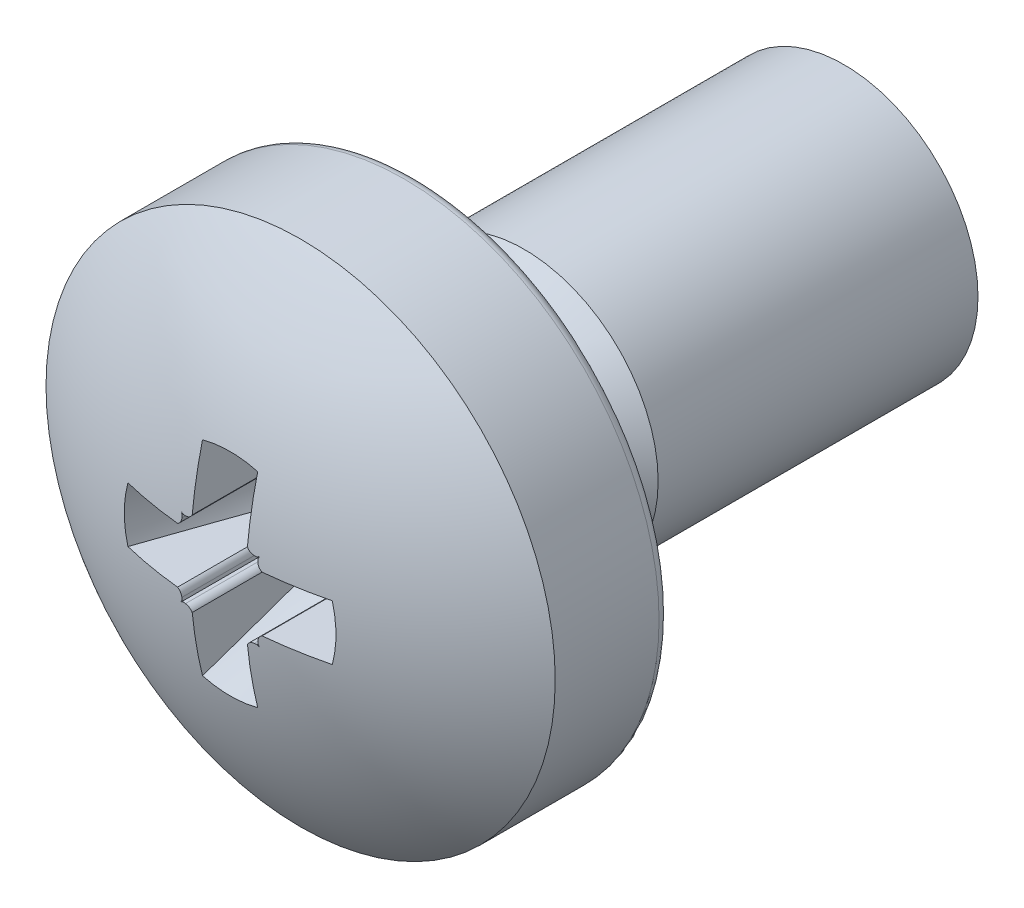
ISO-10303-21;
HEADER;
FILE_DESCRIPTION(('STEP AP214'),'2;1');
FILE_NAME('part.step','',(''),(''),'','','');
FILE_SCHEMA(('AUTOMOTIVE_DESIGN { 1 0 10303 214 1 1 1 1 }'));
ENDSEC;
DATA;
#1=APPLICATION_CONTEXT('core data for automotive mechanical design processes');
#2=APPLICATION_PROTOCOL_DEFINITION('international standard','automotive_design',2000,#1);
#3=PRODUCT_CONTEXT('',#1,'mechanical');
#4=PRODUCT('Part','Part','',(#3));
#5=PRODUCT_RELATED_PRODUCT_CATEGORY('part','',(#4));
#6=PRODUCT_DEFINITION_FORMATION('','',#4);
#7=PRODUCT_DEFINITION_CONTEXT('part definition',#1,'design');
#8=PRODUCT_DEFINITION('design','',#6,#7);
#9=PRODUCT_DEFINITION_SHAPE('','',#8);
#10=(LENGTH_UNIT() NAMED_UNIT(*) SI_UNIT(.MILLI.,.METRE.));
#11=(NAMED_UNIT(*) PLANE_ANGLE_UNIT() SI_UNIT($,.RADIAN.));
#12=(NAMED_UNIT(*) SI_UNIT($,.STERADIAN.) SOLID_ANGLE_UNIT());
#13=UNCERTAINTY_MEASURE_WITH_UNIT(LENGTH_MEASURE(1.E-05),#10,'distance_accuracy_value','');
#14=(GEOMETRIC_REPRESENTATION_CONTEXT(3) GLOBAL_UNCERTAINTY_ASSIGNED_CONTEXT((#13)) GLOBAL_UNIT_ASSIGNED_CONTEXT((#10,
#11,#12)) REPRESENTATION_CONTEXT('',''));
#15=CARTESIAN_POINT('',(0.,0.,0.));
#16=DIRECTION('',(0.,0.,1.));
#17=DIRECTION('',(1.,0.,0.));
#18=AXIS2_PLACEMENT_3D('',#15,#16,#17);
#19=CARTESIAN_POINT('',(0.,0.,-4.3));
#20=DIRECTION('',(1.,0.,0.));
#21=DIRECTION('',(0.,0.,-1.));
#22=AXIS2_PLACEMENT_3D('',#19,#20,#21);
#23=SPHERICAL_SURFACE('',#22,8.);
#24=CARTESIAN_POINT('',(0.,0.,2.13719659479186));
#25=DIRECTION('',(0.,0.,1.));
#26=DIRECTION('',(1.,0.,0.));
#27=AXIS2_PLACEMENT_3D('',#24,#25,#26);
#28=CIRCLE('',#27,4.75);
#29=CARTESIAN_POINT('',(4.75,0.,2.13719659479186));
#30=VERTEX_POINT('',#29);
#31=EDGE_CURVE('E309',#30,#30,#28,.T.);
#32=ORIENTED_EDGE('',*,*,#31,.T.);
#33=EDGE_LOOP('',(#32));
#34=FACE_BOUND('',#33,.T.);
#35=CARTESIAN_POINT('',(0.0255182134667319,-0.730746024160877,-4.3));
#36=DIRECTION('',(-0.0348994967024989,0.999390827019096,0.));
#37=DIRECTION('',(0.999390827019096,0.0348994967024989,0.));
#38=AXIS2_PLACEMENT_3D('',#35,#36,#37);
#39=CIRCLE('',#38,7.96651486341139);
#40=CARTESIAN_POINT('',(0.641767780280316,-0.709226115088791,3.64261496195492));
#41=VERTEX_POINT('',#40);
#42=CARTESIAN_POINT('',(0.691660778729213,-0.707483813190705,3.6385812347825));
#43=VERTEX_POINT('',#42);
#44=EDGE_CURVE('E11',#41,#43,#39,.T.);
#45=ORIENTED_EDGE('',*,*,#44,.F.);
#46=CARTESIAN_POINT('',(0.641767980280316,-0.709226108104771,3.64261494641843));
#47=CARTESIAN_POINT('',(0.633401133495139,-0.709510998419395,3.64326568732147));
#48=CARTESIAN_POINT('',(0.625054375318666,-0.710510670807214,3.64383740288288));
#49=CARTESIAN_POINT('',(0.60864751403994,-0.71388215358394,3.64480900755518));
#50=CARTESIAN_POINT('',(0.600586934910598,-0.716251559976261,3.64520919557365));
#51=CARTESIAN_POINT('',(0.584960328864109,-0.722309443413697,3.64582663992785));
#52=CARTESIAN_POINT('',(0.577394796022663,-0.725999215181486,3.64604371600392));
#53=CARTESIAN_POINT('',(0.562982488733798,-0.734591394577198,3.64628823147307));
#54=CARTESIAN_POINT('',(0.556135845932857,-0.739494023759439,3.64631563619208));
#55=CARTESIAN_POINT('',(0.542704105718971,-0.750935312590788,3.64617226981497));
#56=CARTESIAN_POINT('',(0.53621780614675,-0.757590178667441,3.64598089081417));
#57=CARTESIAN_POINT('',(0.524559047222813,-0.771987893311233,3.64537347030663));
#58=CARTESIAN_POINT('',(0.519390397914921,-0.779733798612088,3.64495678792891));
#59=CARTESIAN_POINT('',(0.514999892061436,-0.78789389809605,3.64443190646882));
#60=B_SPLINE_CURVE_WITH_KNOTS('',3,(#46,#47,#48,#49,#50,#51,#52,#53,#54,#55,#56,#57,#58,#59),
.UNSPECIFIED.,.F.,.F.,(4,2,2,2,2,2,4),(0.,0.0251588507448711,0.0502736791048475,
0.0754132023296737,0.100557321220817,0.128279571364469,0.156081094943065),.UNSPECIFIED.);
#61=CARTESIAN_POINT('',(0.515,-0.787893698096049,3.64443191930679));
#62=VERTEX_POINT('',#61);
#63=EDGE_CURVE('E900',#41,#62,#60,.T.);
#64=ORIENTED_EDGE('',*,*,#63,.T.);
#65=CARTESIAN_POINT('',(0.515,0.,-4.3));
#66=DIRECTION('',(1.,0.,0.));
#67=DIRECTION('',(0.,-1.,0.));
#68=AXIS2_PLACEMENT_3D('',#65,#66,#67);
#69=CIRCLE('',#68,7.98340622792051);
#70=CARTESIAN_POINT('',(0.515,-1.90639349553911,3.4524472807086));
#71=VERTEX_POINT('',#70);
#72=EDGE_CURVE('E944',#62,#71,#69,.T.);
#73=ORIENTED_EDGE('',*,*,#72,.T.);
#74=CARTESIAN_POINT('',(0.,0.,3.4524472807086));
#75=DIRECTION('',(0.,0.,-1.));
#76=DIRECTION('',(0.,1.,0.));
#77=AXIS2_PLACEMENT_3D('',#74,#75,#76);
#78=CIRCLE('',#77,1.9747306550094);
#79=CARTESIAN_POINT('',(-0.515,-1.90639349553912,3.4524472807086));
#80=VERTEX_POINT('',#79);
#81=EDGE_CURVE('E936',#71,#80,#78,.T.);
#82=ORIENTED_EDGE('',*,*,#81,.T.);
#83=CARTESIAN_POINT('',(-0.515,0.,-4.3));
#84=DIRECTION('',(1.,0.,0.));
#85=DIRECTION('',(0.,-1.,0.));
#86=AXIS2_PLACEMENT_3D('',#83,#84,#85);
#87=CIRCLE('',#86,7.98340622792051);
#88=CARTESIAN_POINT('',(-0.515,-0.78789369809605,3.64443191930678));
#89=VERTEX_POINT('',#88);
#90=EDGE_CURVE('E930',#89,#80,#87,.T.);
#91=ORIENTED_EDGE('',*,*,#90,.F.);
#92=CARTESIAN_POINT('',(-0.641767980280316,-0.709226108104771,3.64261494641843));
#93=CARTESIAN_POINT('',(-0.63340113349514,-0.709510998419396,3.64326568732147));
#94=CARTESIAN_POINT('',(-0.625054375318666,-0.710510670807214,3.64383740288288));
#95=CARTESIAN_POINT('',(-0.60864751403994,-0.71388215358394,3.64480900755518));
#96=CARTESIAN_POINT('',(-0.600586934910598,-0.71625155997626,3.64520919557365));
#97=CARTESIAN_POINT('',(-0.584960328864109,-0.722309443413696,3.64582663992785));
#98=CARTESIAN_POINT('',(-0.577394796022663,-0.725999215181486,3.64604371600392));
#99=CARTESIAN_POINT('',(-0.562982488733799,-0.734591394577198,3.64628823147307));
#100=CARTESIAN_POINT('',(-0.556135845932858,-0.73949402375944,3.64631563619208));
#101=CARTESIAN_POINT('',(-0.542704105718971,-0.750935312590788,3.64617226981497));
#102=CARTESIAN_POINT('',(-0.53621780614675,-0.757590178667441,3.64598089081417));
#103=CARTESIAN_POINT('',(-0.524559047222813,-0.771987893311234,3.64537347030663));
#104=CARTESIAN_POINT('',(-0.519390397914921,-0.779733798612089,3.64495678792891));
#105=CARTESIAN_POINT('',(-0.514999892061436,-0.787893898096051,3.64443190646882));
#106=B_SPLINE_CURVE_WITH_KNOTS('',3,(#92,#93,#94,#95,#96,#97,#98,#99,#100,#101,#102,#103,#104,
#105),.UNSPECIFIED.,.F.,.F.,(4,2,2,2,2,2,4),(0.,0.0251588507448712,0.0502736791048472,
0.0754132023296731,0.100557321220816,0.128279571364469,0.156081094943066),.UNSPECIFIED.);
#107=CARTESIAN_POINT('',(-0.641767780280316,-0.709226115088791,3.64261496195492));
#108=VERTEX_POINT('',#107);
#109=EDGE_CURVE('E924',#108,#89,#106,.T.);
#110=ORIENTED_EDGE('',*,*,#109,.F.);
#111=CARTESIAN_POINT('',(-0.0255182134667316,-0.730746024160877,-4.3));
#112=DIRECTION('',(-0.0348994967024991,-0.999390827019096,0.));
#113=DIRECTION('',(-0.999390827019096,0.0348994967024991,0.));
#114=AXIS2_PLACEMENT_3D('',#111,#112,#113);
#115=CIRCLE('',#114,7.96651486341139);
#116=CARTESIAN_POINT('',(-0.691660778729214,-0.707483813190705,3.6385812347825));
#117=VERTEX_POINT('',#116);
#118=EDGE_CURVE('E931',#108,#117,#115,.T.);
#119=ORIENTED_EDGE('',*,*,#118,.T.);
#120=CARTESIAN_POINT('',(-2.70609632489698,2.70609632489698,-1.36344105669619));
#121=DIRECTION('',(-0.560985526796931,0.560985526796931,0.608761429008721));
#122=DIRECTION('',(0.,-0.735373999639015,0.677661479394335));
#123=AXIS2_PLACEMENT_3D('',#120,#121,#122);
#124=CIRCLE('',#123,6.38206133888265);
#125=CARTESIAN_POINT('',(-0.721182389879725,-0.731764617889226,3.63375172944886));
#126=VERTEX_POINT('',#125);
#127=EDGE_CURVE('E970',#126,#117,#124,.T.);
#128=ORIENTED_EDGE('',*,*,#127,.F.);
#129=CARTESIAN_POINT('',(0.477702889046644,0.477702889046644,3.48598924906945));
#130=DIRECTION('',(0.0611245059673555,0.0611245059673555,0.996256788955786));
#131=DIRECTION('',(0.998123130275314,0.,-0.0612390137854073));
#132=AXIS2_PLACEMENT_3D('',#129,#130,#131);
#133=CIRCLE('',#132,1.70937746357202);
#134=CARTESIAN_POINT('',(-0.731764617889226,-0.721182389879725,3.63375172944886));
#135=VERTEX_POINT('',#134);
#136=EDGE_CURVE('E967',#135,#126,#133,.T.);
#137=ORIENTED_EDGE('',*,*,#136,.F.);
#138=CARTESIAN_POINT('',(2.70609632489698,-2.70609632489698,-1.36344105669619));
#139=DIRECTION('',(-0.560985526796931,0.560985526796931,-0.608761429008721));
#140=DIRECTION('',(-0.735373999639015,0.,0.677661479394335));
#141=AXIS2_PLACEMENT_3D('',#138,#139,#140);
#142=CIRCLE('',#141,6.38206133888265);
#143=CARTESIAN_POINT('',(-0.707483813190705,-0.691660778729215,3.6385812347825));
#144=VERTEX_POINT('',#143);
#145=EDGE_CURVE('E968',#135,#144,#142,.T.);
#146=ORIENTED_EDGE('',*,*,#145,.T.);
#147=CARTESIAN_POINT('',(-0.730746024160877,-0.0255182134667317,-4.3));
#148=DIRECTION('',(0.999390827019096,0.0348994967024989,0.));
#149=DIRECTION('',(0.0348994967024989,-0.999390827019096,0.));
#150=AXIS2_PLACEMENT_3D('',#147,#148,#149);
#151=CIRCLE('',#150,7.96651486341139);
#152=CARTESIAN_POINT('',(-0.709226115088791,-0.641767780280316,3.64261496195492));
#153=VERTEX_POINT('',#152);
#154=EDGE_CURVE('E584',#153,#144,#151,.T.);
#155=ORIENTED_EDGE('',*,*,#154,.F.);
#156=CARTESIAN_POINT('',(-0.709226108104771,-0.641767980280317,3.64261494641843));
#157=CARTESIAN_POINT('',(-0.709510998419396,-0.633401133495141,3.64326568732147));
#158=CARTESIAN_POINT('',(-0.710510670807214,-0.625054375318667,3.64383740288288));
#159=CARTESIAN_POINT('',(-0.71388215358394,-0.608647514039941,3.64480900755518));
#160=CARTESIAN_POINT('',(-0.71625155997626,-0.600586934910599,3.64520919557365));
#161=CARTESIAN_POINT('',(-0.722309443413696,-0.58496032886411,3.64582663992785));
#162=CARTESIAN_POINT('',(-0.725999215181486,-0.577394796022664,3.64604371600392));
#163=CARTESIAN_POINT('',(-0.734591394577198,-0.5629824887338,3.64628823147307));
#164=CARTESIAN_POINT('',(-0.739494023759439,-0.556135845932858,3.64631563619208));
#165=CARTESIAN_POINT('',(-0.750935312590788,-0.542704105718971,3.64617226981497));
#166=CARTESIAN_POINT('',(-0.757590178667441,-0.53621780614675,3.64598089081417));
#167=CARTESIAN_POINT('',(-0.771987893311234,-0.524559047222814,3.64537347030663));
#168=CARTESIAN_POINT('',(-0.779733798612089,-0.519390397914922,3.64495678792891));
#169=CARTESIAN_POINT('',(-0.787893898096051,-0.514999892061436,3.64443190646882));
#170=B_SPLINE_CURVE_WITH_KNOTS('',3,(#156,#157,#158,#159,#160,#161,#162,#163,#164,#165,#166,
#167,#168,#169),.UNSPECIFIED.,.F.,.F.,(4,2,2,2,2,2,4),(0.,0.0251588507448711,0.0502736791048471,
0.0754132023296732,0.100557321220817,0.128279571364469,0.156081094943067),.UNSPECIFIED.);
#171=CARTESIAN_POINT('',(-0.787893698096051,-0.515,3.64443191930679));
#172=VERTEX_POINT('',#171);
#173=EDGE_CURVE('E578',#153,#172,#170,.T.);
#174=ORIENTED_EDGE('',*,*,#173,.T.);
#175=CARTESIAN_POINT('',(0.,-0.515,-4.3));
#176=DIRECTION('',(0.,1.,0.));
#177=DIRECTION('',(1.,0.,0.));
#178=AXIS2_PLACEMENT_3D('',#175,#176,#177);
#179=CIRCLE('',#178,7.98340622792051);
#180=CARTESIAN_POINT('',(-1.90639349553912,-0.515,3.4524472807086));
#181=VERTEX_POINT('',#180);
#182=EDGE_CURVE('E569',#181,#172,#179,.T.);
#183=ORIENTED_EDGE('',*,*,#182,.F.);
#184=CARTESIAN_POINT('',(0.,0.,3.4524472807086));
#185=DIRECTION('',(0.,0.,-1.));
#186=DIRECTION('',(0.,1.,0.));
#187=AXIS2_PLACEMENT_3D('',#184,#185,#186);
#188=CIRCLE('',#187,1.9747306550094);
#189=CARTESIAN_POINT('',(-1.90639349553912,0.515,3.4524472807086));
#190=VERTEX_POINT('',#189);
#191=EDGE_CURVE('E563',#181,#190,#188,.T.);
#192=ORIENTED_EDGE('',*,*,#191,.T.);
#193=CARTESIAN_POINT('',(0.,0.515,-4.3));
#194=DIRECTION('',(0.,1.,0.));
#195=DIRECTION('',(1.,0.,0.));
#196=AXIS2_PLACEMENT_3D('',#193,#194,#195);
#197=CIRCLE('',#196,7.98340622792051);
#198=CARTESIAN_POINT('',(-0.78789369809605,0.515,3.64443191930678));
#199=VERTEX_POINT('',#198);
#200=EDGE_CURVE('E610',#190,#199,#197,.T.);
#201=ORIENTED_EDGE('',*,*,#200,.T.);
#202=CARTESIAN_POINT('',(-0.709226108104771,0.641767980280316,3.64261494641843));
#203=CARTESIAN_POINT('',(-0.709510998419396,0.63340113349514,3.64326568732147));
#204=CARTESIAN_POINT('',(-0.710510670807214,0.625054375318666,3.64383740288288));
#205=CARTESIAN_POINT('',(-0.713882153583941,0.60864751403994,3.64480900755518));
#206=CARTESIAN_POINT('',(-0.716251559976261,0.600586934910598,3.64520919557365));
#207=CARTESIAN_POINT('',(-0.722309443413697,0.584960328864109,3.64582663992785));
#208=CARTESIAN_POINT('',(-0.725999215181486,0.577394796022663,3.64604371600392));
#209=CARTESIAN_POINT('',(-0.734591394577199,0.562982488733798,3.64628823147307));
#210=CARTESIAN_POINT('',(-0.739494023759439,0.556135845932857,3.64631563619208));
#211=CARTESIAN_POINT('',(-0.750935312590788,0.542704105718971,3.64617226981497));
#212=CARTESIAN_POINT('',(-0.757590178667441,0.53621780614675,3.64598089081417));
#213=CARTESIAN_POINT('',(-0.771987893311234,0.524559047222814,3.64537347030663));
#214=CARTESIAN_POINT('',(-0.779733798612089,0.519390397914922,3.64495678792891));
#215=CARTESIAN_POINT('',(-0.78789389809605,0.514999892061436,3.64443190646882));
#216=B_SPLINE_CURVE_WITH_KNOTS('',3,(#202,#203,#204,#205,#206,#207,#208,#209,#210,#211,#212,
#213,#214,#215),.UNSPECIFIED.,.F.,.F.,(4,2,2,2,2,2,4),(0.,0.025158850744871,0.0502736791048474,
0.0754132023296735,0.100557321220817,0.128279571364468,0.156081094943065),.UNSPECIFIED.);
#217=CARTESIAN_POINT('',(-0.709226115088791,0.641767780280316,3.64261496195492));
#218=VERTEX_POINT('',#217);
#219=EDGE_CURVE('E602',#218,#199,#216,.T.);
#220=ORIENTED_EDGE('',*,*,#219,.F.);
#221=CARTESIAN_POINT('',(-0.730746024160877,0.0255182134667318,-4.3));
#222=DIRECTION('',(-0.999390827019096,0.0348994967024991,0.));
#223=DIRECTION('',(0.0348994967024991,0.999390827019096,0.));
#224=AXIS2_PLACEMENT_3D('',#221,#222,#223);
#225=CIRCLE('',#224,7.96651486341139);
#226=CARTESIAN_POINT('',(-0.707483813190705,0.691660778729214,3.6385812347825));
#227=VERTEX_POINT('',#226);
#228=EDGE_CURVE('E40',#218,#227,#225,.T.);
#229=ORIENTED_EDGE('',*,*,#228,.T.);
#230=CARTESIAN_POINT('',(2.70609632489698,2.70609632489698,-1.36344105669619));
#231=DIRECTION('',(0.560985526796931,0.560985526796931,0.608761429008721));
#232=DIRECTION('',(0.735373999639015,0.,-0.677661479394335));
#233=AXIS2_PLACEMENT_3D('',#230,#231,#232);
#234=CIRCLE('',#233,6.38206133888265);
#235=CARTESIAN_POINT('',(-0.731764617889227,0.721182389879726,3.63375172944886));
#236=VERTEX_POINT('',#235);
#237=EDGE_CURVE('E344',#236,#227,#234,.T.);
#238=ORIENTED_EDGE('',*,*,#237,.F.);
#239=CARTESIAN_POINT('',(0.477702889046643,-0.477702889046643,3.48598924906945));
#240=DIRECTION('',(0.0611245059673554,-0.0611245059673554,0.996256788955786));
#241=DIRECTION('',(0.998123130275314,0.,-0.0612390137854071));
#242=AXIS2_PLACEMENT_3D('',#239,#240,#241);
#243=CIRCLE('',#242,1.70937746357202);
#244=CARTESIAN_POINT('',(-0.721182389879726,0.731764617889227,3.63375172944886));
#245=VERTEX_POINT('',#244);
#246=EDGE_CURVE('E339',#245,#236,#243,.T.);
#247=ORIENTED_EDGE('',*,*,#246,.F.);
#248=CARTESIAN_POINT('',(-2.70609632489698,-2.70609632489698,-1.36344105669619));
#249=DIRECTION('',(0.560985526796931,0.560985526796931,-0.608761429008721));
#250=DIRECTION('',(-0.735373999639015,0.,-0.677661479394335));
#251=AXIS2_PLACEMENT_3D('',#248,#249,#250);
#252=CIRCLE('',#251,6.38206133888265);
#253=CARTESIAN_POINT('',(-0.691660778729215,0.707483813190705,3.6385812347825));
#254=VERTEX_POINT('',#253);
#255=EDGE_CURVE('E341',#245,#254,#252,.T.);
#256=ORIENTED_EDGE('',*,*,#255,.T.);
#257=CARTESIAN_POINT('',(-0.0255182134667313,0.730746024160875,-4.3));
#258=DIRECTION('',(0.034899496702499,-0.999390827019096,0.));
#259=DIRECTION('',(-0.999390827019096,-0.034899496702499,0.));
#260=AXIS2_PLACEMENT_3D('',#257,#258,#259);
#261=CIRCLE('',#260,7.96651486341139);
#262=CARTESIAN_POINT('',(-0.641767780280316,0.709226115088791,3.64261496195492));
#263=VERTEX_POINT('',#262);
#264=EDGE_CURVE('E346',#263,#254,#261,.T.);
#265=ORIENTED_EDGE('',*,*,#264,.F.);
#266=CARTESIAN_POINT('',(-0.641767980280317,0.709226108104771,3.64261494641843));
#267=CARTESIAN_POINT('',(-0.633401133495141,0.709510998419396,3.64326568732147));
#268=CARTESIAN_POINT('',(-0.625054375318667,0.710510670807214,3.64383740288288));
#269=CARTESIAN_POINT('',(-0.608647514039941,0.71388215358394,3.64480900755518));
#270=CARTESIAN_POINT('',(-0.600586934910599,0.71625155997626,3.64520919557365));
#271=CARTESIAN_POINT('',(-0.58496032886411,0.722309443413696,3.64582663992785));
#272=CARTESIAN_POINT('',(-0.577394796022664,0.725999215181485,3.64604371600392));
#273=CARTESIAN_POINT('',(-0.562982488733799,0.734591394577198,3.64628823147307));
#274=CARTESIAN_POINT('',(-0.556135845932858,0.739494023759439,3.64631563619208));
#275=CARTESIAN_POINT('',(-0.542704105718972,0.750935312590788,3.64617226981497));
#276=CARTESIAN_POINT('',(-0.53621780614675,0.757590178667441,3.64598089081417));
#277=CARTESIAN_POINT('',(-0.524559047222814,0.771987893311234,3.64537347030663));
#278=CARTESIAN_POINT('',(-0.519390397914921,0.779733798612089,3.64495678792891));
#279=CARTESIAN_POINT('',(-0.514999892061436,0.787893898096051,3.64443190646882));
#280=B_SPLINE_CURVE_WITH_KNOTS('',3,(#266,#267,#268,#269,#270,#271,#272,#273,#274,#275,#276,
#277,#278,#279),.UNSPECIFIED.,.F.,.F.,(4,2,2,2,2,2,4),(0.,0.0251588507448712,0.0502736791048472,
0.0754132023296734,0.100557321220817,0.12827957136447,0.156081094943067),.UNSPECIFIED.);
#281=CARTESIAN_POINT('',(-0.515,0.787893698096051,3.64443191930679));
#282=VERTEX_POINT('',#281);
#283=EDGE_CURVE('E348',#263,#282,#280,.T.);
#284=ORIENTED_EDGE('',*,*,#283,.T.);
#285=CARTESIAN_POINT('',(-0.515,0.,-4.3));
#286=DIRECTION('',(1.,0.,0.));
#287=DIRECTION('',(0.,0.,-1.));
#288=AXIS2_PLACEMENT_3D('',#285,#286,#287);
#289=CIRCLE('',#288,7.98340622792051);
#290=CARTESIAN_POINT('',(-0.515,1.90639349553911,3.4524472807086));
#291=VERTEX_POINT('',#290);
#292=EDGE_CURVE('E355',#291,#282,#289,.T.);
#293=ORIENTED_EDGE('',*,*,#292,.F.);
#294=CARTESIAN_POINT('',(0.,0.,3.4524472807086));
#295=DIRECTION('',(0.,0.,-1.));
#296=DIRECTION('',(0.,1.,0.));
#297=AXIS2_PLACEMENT_3D('',#294,#295,#296);
#298=CIRCLE('',#297,1.9747306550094);
#299=CARTESIAN_POINT('',(0.515,1.90639349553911,3.4524472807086));
#300=VERTEX_POINT('',#299);
#301=EDGE_CURVE('E1076',#291,#300,#298,.T.);
#302=ORIENTED_EDGE('',*,*,#301,.T.);
#303=CARTESIAN_POINT('',(0.515,0.,-4.3));
#304=DIRECTION('',(1.,0.,0.));
#305=DIRECTION('',(0.,0.,-1.));
#306=AXIS2_PLACEMENT_3D('',#303,#304,#305);
#307=CIRCLE('',#306,7.98340622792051);
#308=CARTESIAN_POINT('',(0.515,0.787893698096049,3.64443191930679));
#309=VERTEX_POINT('',#308);
#310=EDGE_CURVE('E608',#300,#309,#307,.T.);
#311=ORIENTED_EDGE('',*,*,#310,.T.);
#312=CARTESIAN_POINT('',(0.641767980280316,0.709226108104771,3.64261494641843));
#313=CARTESIAN_POINT('',(0.63340113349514,0.709510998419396,3.64326568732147));
#314=CARTESIAN_POINT('',(0.625054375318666,0.710510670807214,3.64383740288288));
#315=CARTESIAN_POINT('',(0.60864751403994,0.71388215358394,3.64480900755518));
#316=CARTESIAN_POINT('',(0.600586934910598,0.71625155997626,3.64520919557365));
#317=CARTESIAN_POINT('',(0.584960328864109,0.722309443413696,3.64582663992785));
#318=CARTESIAN_POINT('',(0.577394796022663,0.725999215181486,3.64604371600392));
#319=CARTESIAN_POINT('',(0.562982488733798,0.734591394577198,3.64628823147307));
#320=CARTESIAN_POINT('',(0.556135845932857,0.739494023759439,3.64631563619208));
#321=CARTESIAN_POINT('',(0.542704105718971,0.750935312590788,3.64617226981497));
#322=CARTESIAN_POINT('',(0.53621780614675,0.75759017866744,3.64598089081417));
#323=CARTESIAN_POINT('',(0.524559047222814,0.771987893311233,3.64537347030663));
#324=CARTESIAN_POINT('',(0.519390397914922,0.779733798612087,3.64495678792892));
#325=CARTESIAN_POINT('',(0.514999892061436,0.787893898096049,3.64443190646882));
#326=B_SPLINE_CURVE_WITH_KNOTS('',3,(#312,#313,#314,#315,#316,#317,#318,#319,#320,#321,#322,
#323,#324,#325),.UNSPECIFIED.,.F.,.F.,(4,2,2,2,2,2,4),(0.,0.0251588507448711,0.0502736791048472,
0.0754132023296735,0.100557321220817,0.128279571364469,0.156081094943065),.UNSPECIFIED.);
#327=CARTESIAN_POINT('',(0.641767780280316,0.709226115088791,3.64261496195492));
#328=VERTEX_POINT('',#327);
#329=EDGE_CURVE('E556',#328,#309,#326,.T.);
#330=ORIENTED_EDGE('',*,*,#329,.F.);
#331=CARTESIAN_POINT('',(0.0255182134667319,0.730746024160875,-4.3));
#332=DIRECTION('',(0.034899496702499,0.999390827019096,0.));
#333=DIRECTION('',(0.999390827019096,-0.034899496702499,0.));
#334=AXIS2_PLACEMENT_3D('',#331,#332,#333);
#335=CIRCLE('',#334,7.96651486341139);
#336=CARTESIAN_POINT('',(0.691660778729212,0.707483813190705,3.6385812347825));
#337=VERTEX_POINT('',#336);
#338=EDGE_CURVE('E562',#328,#337,#335,.T.);
#339=ORIENTED_EDGE('',*,*,#338,.T.);
#340=CARTESIAN_POINT('',(2.70609632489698,-2.70609632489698,-1.36344105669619));
#341=DIRECTION('',(0.560985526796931,-0.560985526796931,0.608761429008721));
#342=DIRECTION('',(0.,-0.735373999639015,-0.677661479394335));
#343=AXIS2_PLACEMENT_3D('',#340,#341,#342);
#344=CIRCLE('',#343,6.38206133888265);
#345=CARTESIAN_POINT('',(0.721182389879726,0.731764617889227,3.63375172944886));
#346=VERTEX_POINT('',#345);
#347=EDGE_CURVE('E567',#346,#337,#344,.T.);
#348=ORIENTED_EDGE('',*,*,#347,.F.);
#349=CARTESIAN_POINT('',(-0.477702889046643,-0.477702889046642,3.48598924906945));
#350=DIRECTION('',(-0.0611245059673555,-0.0611245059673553,0.996256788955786));
#351=DIRECTION('',(0.998123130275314,0.,0.0612390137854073));
#352=AXIS2_PLACEMENT_3D('',#349,#350,#351);
#353=CIRCLE('',#352,1.70937746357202);
#354=CARTESIAN_POINT('',(0.731764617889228,0.721182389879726,3.63375172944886));
#355=VERTEX_POINT('',#354);
#356=EDGE_CURVE('E571',#355,#346,#353,.T.);
#357=ORIENTED_EDGE('',*,*,#356,.F.);
#358=CARTESIAN_POINT('',(-2.70609632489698,2.70609632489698,-1.36344105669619));
#359=DIRECTION('',(0.560985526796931,-0.560985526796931,-0.608761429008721));
#360=DIRECTION('',(0.,0.735373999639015,-0.677661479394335));
#361=AXIS2_PLACEMENT_3D('',#358,#359,#360);
#362=CIRCLE('',#361,6.38206133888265);
#363=CARTESIAN_POINT('',(0.707483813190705,0.691660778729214,3.6385812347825));
#364=VERTEX_POINT('',#363);
#365=EDGE_CURVE('E573',#355,#364,#362,.T.);
#366=ORIENTED_EDGE('',*,*,#365,.T.);
#367=CARTESIAN_POINT('',(0.730746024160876,0.0255182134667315,-4.3));
#368=DIRECTION('',(-0.999390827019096,-0.0348994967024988,0.));
#369=DIRECTION('',(-0.0348994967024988,0.999390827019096,0.));
#370=AXIS2_PLACEMENT_3D('',#367,#368,#369);
#371=CIRCLE('',#370,7.96651486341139);
#372=CARTESIAN_POINT('',(0.709226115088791,0.641767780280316,3.64261496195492));
#373=VERTEX_POINT('',#372);
#374=EDGE_CURVE('E576',#373,#364,#371,.T.);
#375=ORIENTED_EDGE('',*,*,#374,.F.);
#376=CARTESIAN_POINT('',(0.709226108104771,0.641767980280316,3.64261494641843));
#377=CARTESIAN_POINT('',(0.709510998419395,0.63340113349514,3.64326568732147));
#378=CARTESIAN_POINT('',(0.710510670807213,0.625054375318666,3.64383740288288));
#379=CARTESIAN_POINT('',(0.71388215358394,0.60864751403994,3.64480900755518));
#380=CARTESIAN_POINT('',(0.71625155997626,0.600586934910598,3.64520919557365));
#381=CARTESIAN_POINT('',(0.722309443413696,0.584960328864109,3.64582663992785));
#382=CARTESIAN_POINT('',(0.725999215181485,0.577394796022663,3.64604371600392));
#383=CARTESIAN_POINT('',(0.734591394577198,0.562982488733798,3.64628823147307));
#384=CARTESIAN_POINT('',(0.739494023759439,0.556135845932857,3.64631563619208));
#385=CARTESIAN_POINT('',(0.750935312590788,0.542704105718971,3.64617226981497));
#386=CARTESIAN_POINT('',(0.757590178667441,0.53621780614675,3.64598089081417));
#387=CARTESIAN_POINT('',(0.771987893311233,0.524559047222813,3.64537347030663));
#388=CARTESIAN_POINT('',(0.779733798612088,0.519390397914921,3.64495678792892));
#389=CARTESIAN_POINT('',(0.78789389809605,0.514999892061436,3.64443190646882));
#390=B_SPLINE_CURVE_WITH_KNOTS('',3,(#376,#377,#378,#379,#380,#381,#382,#383,#384,#385,#386,
#387,#388,#389),.UNSPECIFIED.,.F.,.F.,(4,2,2,2,2,2,4),(0.,0.0251588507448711,0.0502736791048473,
0.0754132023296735,0.100557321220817,0.128279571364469,0.156081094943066),.UNSPECIFIED.);
#391=CARTESIAN_POINT('',(0.78789369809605,0.515,3.64443191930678));
#392=VERTEX_POINT('',#391);
#393=EDGE_CURVE('E961',#373,#392,#390,.T.);
#394=ORIENTED_EDGE('',*,*,#393,.T.);
#395=CARTESIAN_POINT('',(0.,0.515,-4.3));
#396=DIRECTION('',(0.,1.,0.));
#397=DIRECTION('',(1.,0.,0.));
#398=AXIS2_PLACEMENT_3D('',#395,#396,#397);
#399=CIRCLE('',#398,7.98340622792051);
#400=CARTESIAN_POINT('',(1.90639349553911,0.515,3.4524472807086));
#401=VERTEX_POINT('',#400);
#402=EDGE_CURVE('E972',#392,#401,#399,.T.);
#403=ORIENTED_EDGE('',*,*,#402,.T.);
#404=CARTESIAN_POINT('',(0.,0.,3.4524472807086));
#405=DIRECTION('',(0.,0.,-1.));
#406=DIRECTION('',(0.,1.,0.));
#407=AXIS2_PLACEMENT_3D('',#404,#405,#406);
#408=CIRCLE('',#407,1.9747306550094);
#409=CARTESIAN_POINT('',(1.90639349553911,-0.515,3.4524472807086));
#410=VERTEX_POINT('',#409);
#411=EDGE_CURVE('E974',#401,#410,#408,.T.);
#412=ORIENTED_EDGE('',*,*,#411,.T.);
#413=CARTESIAN_POINT('',(0.,-0.515,-4.3));
#414=DIRECTION('',(0.,1.,0.));
#415=DIRECTION('',(1.,0.,0.));
#416=AXIS2_PLACEMENT_3D('',#413,#414,#415);
#417=CIRCLE('',#416,7.98340622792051);
#418=CARTESIAN_POINT('',(0.787893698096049,-0.515,3.64443191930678));
#419=VERTEX_POINT('',#418);
#420=EDGE_CURVE('E934',#419,#410,#417,.T.);
#421=ORIENTED_EDGE('',*,*,#420,.F.);
#422=CARTESIAN_POINT('',(0.70922610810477,-0.641767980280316,3.64261494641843));
#423=CARTESIAN_POINT('',(0.709510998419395,-0.63340113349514,3.64326568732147));
#424=CARTESIAN_POINT('',(0.710510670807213,-0.625054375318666,3.64383740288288));
#425=CARTESIAN_POINT('',(0.71388215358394,-0.60864751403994,3.64480900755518));
#426=CARTESIAN_POINT('',(0.71625155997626,-0.600586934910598,3.64520919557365));
#427=CARTESIAN_POINT('',(0.722309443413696,-0.584960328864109,3.64582663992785));
#428=CARTESIAN_POINT('',(0.725999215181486,-0.577394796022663,3.64604371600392));
#429=CARTESIAN_POINT('',(0.734591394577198,-0.562982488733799,3.64628823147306));
#430=CARTESIAN_POINT('',(0.739494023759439,-0.556135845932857,3.64631563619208));
#431=CARTESIAN_POINT('',(0.750935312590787,-0.542704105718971,3.64617226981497));
#432=CARTESIAN_POINT('',(0.75759017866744,-0.53621780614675,3.64598089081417));
#433=CARTESIAN_POINT('',(0.771987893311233,-0.524559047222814,3.64537347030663));
#434=CARTESIAN_POINT('',(0.779733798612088,-0.519390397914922,3.64495678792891));
#435=CARTESIAN_POINT('',(0.787893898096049,-0.514999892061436,3.64443190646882));
#436=B_SPLINE_CURVE_WITH_KNOTS('',3,(#422,#423,#424,#425,#426,#427,#428,#429,#430,#431,#432,
#433,#434,#435),.UNSPECIFIED.,.F.,.F.,(4,2,2,2,2,2,4),(0.,0.0251588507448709,0.0502736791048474,
0.0754132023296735,0.100557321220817,0.128279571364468,0.156081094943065),.UNSPECIFIED.);
#437=CARTESIAN_POINT('',(0.709226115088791,-0.641767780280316,3.64261496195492));
#438=VERTEX_POINT('',#437);
#439=EDGE_CURVE('E939',#438,#419,#436,.T.);
#440=ORIENTED_EDGE('',*,*,#439,.F.);
#441=CARTESIAN_POINT('',(0.730746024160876,-0.0255182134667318,-4.3));
#442=DIRECTION('',(0.999390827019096,-0.0348994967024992,0.));
#443=DIRECTION('',(-0.0348994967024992,-0.999390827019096,0.));
#444=AXIS2_PLACEMENT_3D('',#441,#442,#443);
#445=CIRCLE('',#444,7.96651486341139);
#446=CARTESIAN_POINT('',(0.707483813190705,-0.691660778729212,3.6385812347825));
#447=VERTEX_POINT('',#446);
#448=EDGE_CURVE('E1117',#438,#447,#445,.T.);
#449=ORIENTED_EDGE('',*,*,#448,.T.);
#450=CARTESIAN_POINT('',(-2.70609632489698,-2.70609632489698,-1.36344105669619));
#451=DIRECTION('',(-0.560985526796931,-0.560985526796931,0.608761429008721));
#452=DIRECTION('',(0.735373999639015,0.,0.677661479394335));
#453=AXIS2_PLACEMENT_3D('',#450,#451,#452);
#454=CIRCLE('',#453,6.38206133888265);
#455=CARTESIAN_POINT('',(0.731764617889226,-0.721182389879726,3.63375172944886));
#456=VERTEX_POINT('',#455);
#457=EDGE_CURVE('E907',#456,#447,#454,.T.);
#458=ORIENTED_EDGE('',*,*,#457,.F.);
#459=CARTESIAN_POINT('',(-0.477702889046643,0.477702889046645,3.48598924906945));
#460=DIRECTION('',(-0.0611245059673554,0.0611245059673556,0.996256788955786));
#461=DIRECTION('',(0.,-0.998123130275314,0.0612390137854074));
#462=AXIS2_PLACEMENT_3D('',#459,#460,#461);
#463=CIRCLE('',#462,1.70937746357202);
#464=CARTESIAN_POINT('',(0.721182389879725,-0.731764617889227,3.63375172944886));
#465=VERTEX_POINT('',#464);
#466=EDGE_CURVE('E899',#465,#456,#463,.T.);
#467=ORIENTED_EDGE('',*,*,#466,.F.);
#468=CARTESIAN_POINT('',(2.70609632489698,2.70609632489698,-1.36344105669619));
#469=DIRECTION('',(-0.560985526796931,-0.560985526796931,-0.608761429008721));
#470=DIRECTION('',(0.,0.735373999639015,-0.677661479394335));
#471=AXIS2_PLACEMENT_3D('',#468,#469,#470);
#472=CIRCLE('',#471,6.38206133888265);
#473=EDGE_CURVE('E25',#465,#43,#472,.T.);
#474=ORIENTED_EDGE('',*,*,#473,.T.);
#475=EDGE_LOOP('',(#45,#64,#73,#82,#91,#110,#119,#128,#137,#146,#155,#174,#183,#192,#201,#220,
#229,#238,#247,#256,#265,#284,#293,#302,#311,#330,#339,#348,#357,#366,#375,#394,#403,#412,#421,
#440,#449,#458,#467,#474));
#476=FACE_BOUND('',#475,.T.);
#477=ADVANCED_FACE('F17',(#34,#476),#23,.T.);
#478=CARTESIAN_POINT('',(0.,0.,-8.));
#479=DIRECTION('',(0.,0.,1.));
#480=DIRECTION('',(1.,0.,0.));
#481=AXIS2_PLACEMENT_3D('',#478,#479,#480);
#482=PLANE('',#481);
#483=CARTESIAN_POINT('',(0.,0.,-8.));
#484=DIRECTION('',(0.,0.,1.));
#485=DIRECTION('',(1.,0.,0.));
#486=AXIS2_PLACEMENT_3D('',#483,#484,#485);
#487=CIRCLE('',#486,2.5);
#488=CARTESIAN_POINT('',(2.5,0.,-8.));
#489=VERTEX_POINT('',#488);
#490=EDGE_CURVE('E336',#489,#489,#487,.T.);
#491=ORIENTED_EDGE('',*,*,#490,.F.);
#492=EDGE_LOOP('',(#491));
#493=FACE_BOUND('',#492,.T.);
#494=ADVANCED_FACE('F701',(#493),#482,.F.);
#495=CARTESIAN_POINT('',(0.,0.,0.));
#496=DIRECTION('',(0.,0.,1.));
#497=DIRECTION('',(1.,0.,0.));
#498=AXIS2_PLACEMENT_3D('',#495,#496,#497);
#499=CYLINDRICAL_SURFACE('',#498,2.5);
#500=CARTESIAN_POINT('',(0.,0.,-2.033));
#501=DIRECTION('',(0.,0.,1.));
#502=DIRECTION('',(1.,0.,0.));
#503=AXIS2_PLACEMENT_3D('',#500,#501,#502);
#504=CIRCLE('',#503,2.5);
#505=CARTESIAN_POINT('',(2.5,0.,-2.033));
#506=VERTEX_POINT('',#505);
#507=EDGE_CURVE('E333',#506,#506,#504,.T.);
#508=ORIENTED_EDGE('',*,*,#507,.F.);
#509=EDGE_LOOP('',(#508));
#510=FACE_BOUND('',#509,.T.);
#511=ORIENTED_EDGE('',*,*,#490,.T.);
#512=EDGE_LOOP('',(#511));
#513=FACE_BOUND('',#512,.T.);
#514=ADVANCED_FACE('F706',(#510,#513),#499,.T.);
#515=CARTESIAN_POINT('',(0.,0.,-2.033));
#516=DIRECTION('',(0.,0.,-1.));
#517=DIRECTION('',(-1.,0.,0.));
#518=AXIS2_PLACEMENT_3D('',#515,#516,#517);
#519=CONICAL_SURFACE('',#518,2.5,0.785398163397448);
#520=CARTESIAN_POINT('',(0.,0.,-1.6));
#521=DIRECTION('',(0.,0.,1.));
#522=DIRECTION('',(1.,0.,0.));
#523=AXIS2_PLACEMENT_3D('',#520,#521,#522);
#524=CIRCLE('',#523,2.067);
#525=CARTESIAN_POINT('',(2.067,0.,-1.6));
#526=VERTEX_POINT('',#525);
#527=EDGE_CURVE('E330',#526,#526,#524,.T.);
#528=ORIENTED_EDGE('',*,*,#527,.F.);
#529=EDGE_LOOP('',(#528));
#530=FACE_BOUND('',#529,.T.);
#531=ORIENTED_EDGE('',*,*,#507,.T.);
#532=EDGE_LOOP('',(#531));
#533=FACE_BOUND('',#532,.T.);
#534=ADVANCED_FACE('F743',(#530,#533),#519,.T.);
#535=CARTESIAN_POINT('',(0.,0.,0.));
#536=DIRECTION('',(0.,0.,1.));
#537=DIRECTION('',(1.,0.,0.));
#538=AXIS2_PLACEMENT_3D('',#535,#536,#537);
#539=CYLINDRICAL_SURFACE('',#538,2.067);
#540=CARTESIAN_POINT('',(0.,0.,-1.52));
#541=DIRECTION('',(0.,0.,1.));
#542=DIRECTION('',(1.,0.,0.));
#543=AXIS2_PLACEMENT_3D('',#540,#541,#542);
#544=CIRCLE('',#543,2.067);
#545=CARTESIAN_POINT('',(2.067,0.,-1.52));
#546=VERTEX_POINT('',#545);
#547=EDGE_CURVE('E327',#546,#546,#544,.T.);
#548=ORIENTED_EDGE('',*,*,#547,.F.);
#549=EDGE_LOOP('',(#548));
#550=FACE_BOUND('',#549,.T.);
#551=ORIENTED_EDGE('',*,*,#527,.T.);
#552=EDGE_LOOP('',(#551));
#553=FACE_BOUND('',#552,.T.);
#554=ADVANCED_FACE('F739',(#550,#553),#539,.T.);
#555=CARTESIAN_POINT('',(0.,0.,-1.52));
#556=DIRECTION('',(0.,0.,1.));
#557=DIRECTION('',(1.,0.,0.));
#558=AXIS2_PLACEMENT_3D('',#555,#556,#557);
#559=TOROIDAL_SURFACE('',#558,2.267,0.2);
#560=ORIENTED_EDGE('',*,*,#547,.T.);
#561=EDGE_LOOP('',(#560));
#562=FACE_BOUND('',#561,.T.);
#563=CARTESIAN_POINT('',(0.,0.,-1.40879853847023));
#564=DIRECTION('',(0.,0.,1.));
#565=DIRECTION('',(1.,0.,0.));
#566=AXIS2_PLACEMENT_3D('',#563,#564,#565);
#567=CIRCLE('',#566,2.10076451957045);
#568=CARTESIAN_POINT('',(2.10076451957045,0.,-1.40879853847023));
#569=VERTEX_POINT('',#568);
#570=EDGE_CURVE('E324',#569,#569,#567,.T.);
#571=ORIENTED_EDGE('',*,*,#570,.F.);
#572=EDGE_LOOP('',(#571));
#573=FACE_BOUND('',#572,.T.);
#574=ADVANCED_FACE('F733',(#562,#573),#559,.F.);
#575=CARTESIAN_POINT('',(0.,0.,-1.40879853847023));
#576=DIRECTION('',(0.,0.,1.));
#577=DIRECTION('',(1.,0.,0.));
#578=AXIS2_PLACEMENT_3D('',#575,#576,#577);
#579=CONICAL_SURFACE('',#578,2.10076451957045,0.589574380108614);
#580=CARTESIAN_POINT('',(0.,0.,-0.0887985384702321));
#581=DIRECTION('',(0.,0.,1.));
#582=DIRECTION('',(1.,0.,0.));
#583=AXIS2_PLACEMENT_3D('',#580,#581,#582);
#584=CIRCLE('',#583,2.98376451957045);
#585=CARTESIAN_POINT('',(2.98376451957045,0.,-0.0887985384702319));
#586=VERTEX_POINT('',#585);
#587=EDGE_CURVE('E321',#586,#586,#584,.T.);
#588=ORIENTED_EDGE('',*,*,#587,.F.);
#589=EDGE_LOOP('',(#588));
#590=FACE_BOUND('',#589,.T.);
#591=ORIENTED_EDGE('',*,*,#570,.T.);
#592=EDGE_LOOP('',(#591));
#593=FACE_BOUND('',#592,.T.);
#594=ADVANCED_FACE('F727',(#590,#593),#579,.T.);
#595=CARTESIAN_POINT('',(0.,0.,-0.2));
#596=DIRECTION('',(0.,0.,1.));
#597=DIRECTION('',(1.,0.,0.));
#598=AXIS2_PLACEMENT_3D('',#595,#596,#597);
#599=TOROIDAL_SURFACE('',#598,3.15,0.2);
#600=ORIENTED_EDGE('',*,*,#587,.T.);
#601=EDGE_LOOP('',(#600));
#602=FACE_BOUND('',#601,.T.);
#603=CARTESIAN_POINT('',(0.,0.,0.));
#604=DIRECTION('',(0.,0.,1.));
#605=DIRECTION('',(1.,0.,0.));
#606=AXIS2_PLACEMENT_3D('',#603,#604,#605);
#607=CIRCLE('',#606,3.15);
#608=CARTESIAN_POINT('',(3.15,0.,0.));
#609=VERTEX_POINT('',#608);
#610=EDGE_CURVE('E318',#609,#609,#607,.T.);
#611=ORIENTED_EDGE('',*,*,#610,.F.);
#612=EDGE_LOOP('',(#611));
#613=FACE_BOUND('',#612,.T.);
#614=ADVANCED_FACE('F722',(#602,#613),#599,.F.);
#615=CARTESIAN_POINT('',(0.,3.15,0.));
#616=DIRECTION('',(0.,0.,1.));
#617=DIRECTION('',(1.,0.,0.));
#618=AXIS2_PLACEMENT_3D('',#615,#616,#617);
#619=PLANE('',#618);
#620=CARTESIAN_POINT('',(0.,0.,0.));
#621=DIRECTION('',(0.,0.,1.));
#622=DIRECTION('',(1.,0.,0.));
#623=AXIS2_PLACEMENT_3D('',#620,#621,#622);
#624=CIRCLE('',#623,4.55);
#625=CARTESIAN_POINT('',(4.55,0.,0.));
#626=VERTEX_POINT('',#625);
#627=EDGE_CURVE('E315',#626,#626,#624,.T.);
#628=ORIENTED_EDGE('',*,*,#627,.F.);
#629=EDGE_LOOP('',(#628));
#630=FACE_BOUND('',#629,.T.);
#631=ORIENTED_EDGE('',*,*,#610,.T.);
#632=EDGE_LOOP('',(#631));
#633=FACE_BOUND('',#632,.T.);
#634=ADVANCED_FACE('F717',(#630,#633),#619,.F.);
#635=CARTESIAN_POINT('',(0.,0.,0.2));
#636=DIRECTION('',(0.,0.,1.));
#637=DIRECTION('',(1.,0.,0.));
#638=AXIS2_PLACEMENT_3D('',#635,#636,#637);
#639=TOROIDAL_SURFACE('',#638,4.55,0.2);
#640=CARTESIAN_POINT('',(0.,0.,0.2));
#641=DIRECTION('',(0.,0.,1.));
#642=DIRECTION('',(1.,0.,0.));
#643=AXIS2_PLACEMENT_3D('',#640,#641,#642);
#644=CIRCLE('',#643,4.75);
#645=CARTESIAN_POINT('',(4.75,0.,0.2));
#646=VERTEX_POINT('',#645);
#647=EDGE_CURVE('E312',#646,#646,#644,.T.);
#648=ORIENTED_EDGE('',*,*,#647,.F.);
#649=EDGE_LOOP('',(#648));
#650=FACE_BOUND('',#649,.T.);
#651=ORIENTED_EDGE('',*,*,#627,.T.);
#652=EDGE_LOOP('',(#651));
#653=FACE_BOUND('',#652,.T.);
#654=ADVANCED_FACE('F712',(#650,#653),#639,.T.);
#655=CARTESIAN_POINT('',(0.,0.,0.));
#656=DIRECTION('',(0.,0.,1.));
#657=DIRECTION('',(1.,0.,0.));
#658=AXIS2_PLACEMENT_3D('',#655,#656,#657);
#659=CYLINDRICAL_SURFACE('',#658,4.75);
#660=ORIENTED_EDGE('',*,*,#31,.F.);
#661=EDGE_LOOP('',(#660));
#662=FACE_BOUND('',#661,.T.);
#663=ORIENTED_EDGE('',*,*,#647,.T.);
#664=EDGE_LOOP('',(#663));
#665=FACE_BOUND('',#664,.T.);
#666=ADVANCED_FACE('F399',(#662,#665),#659,.T.);
#667=CARTESIAN_POINT('',(-0.859134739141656,0.647002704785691,0.40189996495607));
#668=DIRECTION('',(0.,0.,1.));
#669=DIRECTION('',(0.,-1.,0.));
#670=AXIS2_PLACEMENT_3D('',#667,#668,#669);
#671=CYLINDRICAL_SURFACE('',#670,0.15);
#672=ORIENTED_EDGE('',*,*,#219,.T.);
#673=DIRECTION('',(0.,0.,1.));
#674=VECTOR('',#673,1.);
#675=CARTESIAN_POINT('',(-0.78789369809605,0.515,0.40189996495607));
#676=LINE('',#675,#674);
#677=CARTESIAN_POINT('',(-0.78789369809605,0.515,0.902385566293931));
#678=VERTEX_POINT('',#677);
#679=EDGE_CURVE('E1024',#199,#678,#676,.F.);
#680=ORIENTED_EDGE('',*,*,#679,.T.);
#681=CARTESIAN_POINT('',(-0.78789389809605,0.514999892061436,0.902385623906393));
#682=CARTESIAN_POINT('',(-0.781585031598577,0.518394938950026,0.900563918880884));
#683=CARTESIAN_POINT('',(-0.775461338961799,0.522292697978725,0.899007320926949));
#684=CARTESIAN_POINT('',(-0.763760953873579,0.531001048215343,0.896488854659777));
#685=CARTESIAN_POINT('',(-0.758184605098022,0.535812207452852,0.89552735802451));
#686=CARTESIAN_POINT('',(-0.747750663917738,0.546263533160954,0.894264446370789));
#687=CARTESIAN_POINT('',(-0.742894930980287,0.551905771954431,0.893964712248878));
#688=CARTESIAN_POINT('',(-0.734081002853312,0.563837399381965,0.89404944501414));
#689=CARTESIAN_POINT('',(-0.730121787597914,0.570126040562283,0.894433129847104));
#690=CARTESIAN_POINT('',(-0.723301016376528,0.582967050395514,0.895836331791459));
#691=CARTESIAN_POINT('',(-0.720410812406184,0.589506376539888,0.89683697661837));
#692=CARTESIAN_POINT('',(-0.715609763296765,0.602835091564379,0.899400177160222));
#693=CARTESIAN_POINT('',(-0.713699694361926,0.609624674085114,0.900963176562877));
#694=CARTESIAN_POINT('',(-0.711401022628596,0.620670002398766,0.903882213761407));
#695=CARTESIAN_POINT('',(-0.710710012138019,0.624905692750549,0.905090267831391));
#696=CARTESIAN_POINT('',(-0.709696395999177,0.633356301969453,0.907666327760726));
#697=CARTESIAN_POINT('',(-0.709372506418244,0.63757124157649,0.909033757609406));
#698=CARTESIAN_POINT('',(-0.709226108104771,0.641767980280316,0.910473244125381));
#699=B_SPLINE_CURVE_WITH_KNOTS('',3,(#681,#682,#683,#684,#685,#686,#687,#688,#689,#690,#691,
#692,#693,#694,#695,#696,#697,#698),.UNSPECIFIED.,.F.,.F.,(4,2,2,2,2,2,2,2,4),(0.,
0.0221656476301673,0.0443451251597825,0.0665808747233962,0.0887911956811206,0.1103536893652,
0.131933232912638,0.14529207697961,0.15860405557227),.UNSPECIFIED.);
#700=CARTESIAN_POINT('',(-0.709226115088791,0.641767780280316,0.910473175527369));
#701=VERTEX_POINT('',#700);
#702=EDGE_CURVE('E530',#678,#701,#699,.T.);
#703=ORIENTED_EDGE('',*,*,#702,.T.);
#704=DIRECTION('',(0.,0.,1.));
#705=VECTOR('',#704,1.);
#706=CARTESIAN_POINT('',(-0.709226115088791,0.641767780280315,0.40189996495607));
#707=LINE('',#706,#705);
#708=EDGE_CURVE('E1002',#701,#218,#707,.T.);
#709=ORIENTED_EDGE('',*,*,#708,.T.);
#710=EDGE_LOOP('',(#672,#680,#703,#709));
#711=FACE_BOUND('',#710,.T.);
#712=ADVANCED_FACE('F594',(#711),#671,.T.);
#713=CARTESIAN_POINT('',(-0.706949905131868,0.706949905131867,0.40189996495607));
#714=DIRECTION('',(-0.999390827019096,0.0348994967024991,0.));
#715=DIRECTION('',(-0.0348994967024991,-0.999390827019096,0.));
#716=AXIS2_PLACEMENT_3D('',#713,#714,#715);
#717=PLANE('',#716);
#718=ORIENTED_EDGE('',*,*,#708,.F.);
#719=CARTESIAN_POINT('',(-0.706949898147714,0.706950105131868,0.933491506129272));
#720=CARTESIAN_POINT('',(-0.707328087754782,0.6961201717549,0.929559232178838));
#721=CARTESIAN_POINT('',(-0.707706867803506,0.685273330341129,0.925674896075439));
#722=CARTESIAN_POINT('',(-0.7084656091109,0.663545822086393,0.918002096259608));
#723=CARTESIAN_POINT('',(-0.708845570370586,0.652665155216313,0.914213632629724));
#724=CARTESIAN_POINT('',(-0.709226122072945,0.641767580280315,0.910473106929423));
#725=B_SPLINE_CURVE_WITH_KNOTS('',3,(#719,#720,#721,#722,#723,#724),.UNSPECIFIED.,.F.,.F.,(4,2,
4),(0.,0.0345827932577,0.0691656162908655),.UNSPECIFIED.);
#726=CARTESIAN_POINT('',(-0.706949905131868,0.706949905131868,0.933491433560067));
#727=VERTEX_POINT('',#726);
#728=EDGE_CURVE('E282',#727,#701,#725,.T.);
#729=ORIENTED_EDGE('',*,*,#728,.F.);
#730=DIRECTION('',(0.,0.,1.));
#731=VECTOR('',#730,1.);
#732=CARTESIAN_POINT('',(-0.706949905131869,0.706949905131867,0.40189996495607));
#733=LINE('',#732,#731);
#734=CARTESIAN_POINT('',(-0.706949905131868,0.706949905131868,3.63135602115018));
#735=VERTEX_POINT('',#734);
#736=EDGE_CURVE('E277',#727,#735,#733,.T.);
#737=ORIENTED_EDGE('',*,*,#736,.T.);
#738=DIRECTION('',(0.0348385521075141,0.99764560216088,0.059072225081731));
#739=VECTOR('',#738,1.);
#740=CARTESIAN_POINT('',(-0.713596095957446,0.516627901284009,3.62008674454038));
#741=LINE('',#740,#739);
#742=CARTESIAN_POINT('',(-0.707203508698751,0.699687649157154,3.63092601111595));
#743=VERTEX_POINT('',#742);
#744=EDGE_CURVE('E280',#743,#735,#741,.T.);
#745=ORIENTED_EDGE('',*,*,#744,.F.);
#746=DIRECTION('',(0.0252627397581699,0.723430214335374,-0.689935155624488));
#747=VECTOR('',#746,1.);
#748=CARTESIAN_POINT('',(-0.650789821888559,2.31516427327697,2.09024649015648));
#749=LINE('',#748,#747);
#750=EDGE_CURVE('E302',#227,#743,#749,.T.);
#751=ORIENTED_EDGE('',*,*,#750,.F.);
#752=ORIENTED_EDGE('',*,*,#228,.F.);
#753=EDGE_LOOP('',(#718,#729,#737,#745,#751,#752));
#754=FACE_BOUND('',#753,.T.);
#755=ADVANCED_FACE('F279',(#754),#717,.F.);
#756=CARTESIAN_POINT('',(0.706949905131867,0.706949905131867,0.40189996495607));
#757=DIRECTION('',(0.034899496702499,0.999390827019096,0.));
#758=DIRECTION('',(-0.999390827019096,0.034899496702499,0.));
#759=AXIS2_PLACEMENT_3D('',#756,#757,#758);
#760=PLANE('',#759);
#761=DIRECTION('',(0.,0.,1.));
#762=VECTOR('',#761,1.);
#763=CARTESIAN_POINT('',(0.641767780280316,0.709226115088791,0.40189996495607));
#764=LINE('',#763,#762);
#765=CARTESIAN_POINT('',(0.641767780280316,0.709226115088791,0.910473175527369));
#766=VERTEX_POINT('',#765);
#767=EDGE_CURVE('E1010',#766,#328,#764,.T.);
#768=ORIENTED_EDGE('',*,*,#767,.F.);
#769=CARTESIAN_POINT('',(0.706950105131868,0.706949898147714,0.933491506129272));
#770=CARTESIAN_POINT('',(0.6961201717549,0.707328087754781,0.929559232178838));
#771=CARTESIAN_POINT('',(0.685273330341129,0.707706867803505,0.925674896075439));
#772=CARTESIAN_POINT('',(0.663545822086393,0.708465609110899,0.918002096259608));
#773=CARTESIAN_POINT('',(0.652665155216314,0.708845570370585,0.914213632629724));
#774=CARTESIAN_POINT('',(0.641767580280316,0.709226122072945,0.910473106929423));
#775=B_SPLINE_CURVE_WITH_KNOTS('',3,(#769,#770,#771,#772,#773,#774),.UNSPECIFIED.,.F.,.F.,(4,2,
4),(0.,0.0345827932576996,0.0691656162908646),.UNSPECIFIED.);
#776=CARTESIAN_POINT('',(0.706949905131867,0.706949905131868,0.933491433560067));
#777=VERTEX_POINT('',#776);
#778=EDGE_CURVE('E381',#777,#766,#775,.T.);
#779=ORIENTED_EDGE('',*,*,#778,.F.);
#780=DIRECTION('',(0.,0.,1.));
#781=VECTOR('',#780,1.);
#782=CARTESIAN_POINT('',(0.706949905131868,0.706949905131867,0.40189996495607));
#783=LINE('',#782,#781);
#784=CARTESIAN_POINT('',(0.706949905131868,0.706949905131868,3.63135602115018));
#785=VERTEX_POINT('',#784);
#786=EDGE_CURVE('E1013',#777,#785,#783,.T.);
#787=ORIENTED_EDGE('',*,*,#786,.T.);
#788=DIRECTION('',(0.99764560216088,-0.034838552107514,0.0590722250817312));
#789=VECTOR('',#788,1.);
#790=CARTESIAN_POINT('',(0.516627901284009,0.713596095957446,3.62008674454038));
#791=LINE('',#790,#789);
#792=CARTESIAN_POINT('',(0.699687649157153,0.707203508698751,3.63092601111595));
#793=VERTEX_POINT('',#792);
#794=EDGE_CURVE('E1093',#793,#785,#791,.T.);
#795=ORIENTED_EDGE('',*,*,#794,.F.);
#796=DIRECTION('',(0.723430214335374,-0.0252627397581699,-0.689935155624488));
#797=VECTOR('',#796,1.);
#798=CARTESIAN_POINT('',(2.31516427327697,0.650789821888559,2.09024649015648));
#799=LINE('',#798,#797);
#800=EDGE_CURVE('E1096',#337,#793,#799,.T.);
#801=ORIENTED_EDGE('',*,*,#800,.F.);
#802=ORIENTED_EDGE('',*,*,#338,.F.);
#803=EDGE_LOOP('',(#768,#779,#787,#795,#801,#802));
#804=FACE_BOUND('',#803,.T.);
#805=ADVANCED_FACE('F365',(#804),#760,.F.);
#806=CARTESIAN_POINT('',(0.647002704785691,0.859134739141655,0.40189996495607));
#807=DIRECTION('',(0.,0.,1.));
#808=DIRECTION('',(-1.,0.,0.));
#809=AXIS2_PLACEMENT_3D('',#806,#807,#808);
#810=CYLINDRICAL_SURFACE('',#809,0.15);
#811=ORIENTED_EDGE('',*,*,#329,.T.);
#812=DIRECTION('',(0.,0.,1.));
#813=VECTOR('',#812,1.);
#814=CARTESIAN_POINT('',(0.515,0.787893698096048,0.40189996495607));
#815=LINE('',#814,#813);
#816=CARTESIAN_POINT('',(0.515,0.787893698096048,0.902385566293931));
#817=VERTEX_POINT('',#816);
#818=EDGE_CURVE('E286',#309,#817,#815,.F.);
#819=ORIENTED_EDGE('',*,*,#818,.T.);
#820=CARTESIAN_POINT('',(0.514999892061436,0.787893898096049,0.902385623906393));
#821=CARTESIAN_POINT('',(0.518394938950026,0.781585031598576,0.900563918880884));
#822=CARTESIAN_POINT('',(0.522292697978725,0.775461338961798,0.899007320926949));
#823=CARTESIAN_POINT('',(0.531001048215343,0.763760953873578,0.896488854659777));
#824=CARTESIAN_POINT('',(0.535812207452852,0.758184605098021,0.89552735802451));
#825=CARTESIAN_POINT('',(0.546263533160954,0.747750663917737,0.894264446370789));
#826=CARTESIAN_POINT('',(0.551905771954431,0.742894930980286,0.893964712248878));
#827=CARTESIAN_POINT('',(0.563837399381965,0.734081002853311,0.89404944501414));
#828=CARTESIAN_POINT('',(0.570126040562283,0.730121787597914,0.894433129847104));
#829=CARTESIAN_POINT('',(0.582967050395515,0.723301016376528,0.895836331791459));
#830=CARTESIAN_POINT('',(0.589506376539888,0.720410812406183,0.89683697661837));
#831=CARTESIAN_POINT('',(0.602835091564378,0.715609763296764,0.899400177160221));
#832=CARTESIAN_POINT('',(0.609624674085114,0.713699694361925,0.900963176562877));
#833=CARTESIAN_POINT('',(0.620670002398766,0.711401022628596,0.903882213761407));
#834=CARTESIAN_POINT('',(0.624905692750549,0.710710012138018,0.905090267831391));
#835=CARTESIAN_POINT('',(0.633356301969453,0.709696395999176,0.907666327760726));
#836=CARTESIAN_POINT('',(0.63757124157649,0.709372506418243,0.909033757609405));
#837=CARTESIAN_POINT('',(0.641767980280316,0.709226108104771,0.910473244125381));
#838=B_SPLINE_CURVE_WITH_KNOTS('',3,(#820,#821,#822,#823,#824,#825,#826,#827,#828,#829,#830,
#831,#832,#833,#834,#835,#836,#837),.UNSPECIFIED.,.F.,.F.,(4,2,2,2,2,2,2,2,4),(0.,
0.0221656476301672,0.0443451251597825,0.0665808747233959,0.0887911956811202,0.1103536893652,
0.131933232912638,0.145292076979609,0.15860405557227),.UNSPECIFIED.);
#839=EDGE_CURVE('E542',#817,#766,#838,.T.);
#840=ORIENTED_EDGE('',*,*,#839,.T.);
#841=ORIENTED_EDGE('',*,*,#767,.T.);
#842=EDGE_LOOP('',(#811,#819,#840,#841));
#843=FACE_BOUND('',#842,.T.);
#844=ADVANCED_FACE('F547',(#843),#810,.T.);
#845=CARTESIAN_POINT('',(0.859134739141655,-0.647002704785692,0.40189996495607));
#846=DIRECTION('',(0.,0.,1.));
#847=DIRECTION('',(0.,1.,0.));
#848=AXIS2_PLACEMENT_3D('',#845,#846,#847);
#849=CYLINDRICAL_SURFACE('',#848,0.15);
#850=ORIENTED_EDGE('',*,*,#439,.T.);
#851=DIRECTION('',(0.,0.,1.));
#852=VECTOR('',#851,1.);
#853=CARTESIAN_POINT('',(0.787893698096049,-0.515,0.40189996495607));
#854=LINE('',#853,#852);
#855=CARTESIAN_POINT('',(0.787893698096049,-0.515,0.902385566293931));
#856=VERTEX_POINT('',#855);
#857=EDGE_CURVE('E1030',#856,#419,#854,.T.);
#858=ORIENTED_EDGE('',*,*,#857,.F.);
#859=CARTESIAN_POINT('',(0.787893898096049,-0.514999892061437,0.902385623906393));
#860=CARTESIAN_POINT('',(0.781585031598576,-0.518394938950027,0.900563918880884));
#861=CARTESIAN_POINT('',(0.775461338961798,-0.522292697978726,0.899007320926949));
#862=CARTESIAN_POINT('',(0.763760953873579,-0.531001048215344,0.896488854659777));
#863=CARTESIAN_POINT('',(0.758184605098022,-0.535812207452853,0.89552735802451));
#864=CARTESIAN_POINT('',(0.747750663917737,-0.546263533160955,0.894264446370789));
#865=CARTESIAN_POINT('',(0.742894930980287,-0.551905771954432,0.893964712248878));
#866=CARTESIAN_POINT('',(0.734081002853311,-0.563837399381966,0.89404944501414));
#867=CARTESIAN_POINT('',(0.730121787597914,-0.570126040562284,0.894433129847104));
#868=CARTESIAN_POINT('',(0.723301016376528,-0.582967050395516,0.895836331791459));
#869=CARTESIAN_POINT('',(0.720410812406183,-0.589506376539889,0.89683697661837));
#870=CARTESIAN_POINT('',(0.715609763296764,-0.602835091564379,0.899400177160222));
#871=CARTESIAN_POINT('',(0.713699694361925,-0.609624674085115,0.900963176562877));
#872=CARTESIAN_POINT('',(0.711401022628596,-0.620670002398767,0.903882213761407));
#873=CARTESIAN_POINT('',(0.710710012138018,-0.62490569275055,0.905090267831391));
#874=CARTESIAN_POINT('',(0.709696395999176,-0.633356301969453,0.907666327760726));
#875=CARTESIAN_POINT('',(0.709372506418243,-0.63757124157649,0.909033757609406));
#876=CARTESIAN_POINT('',(0.70922610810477,-0.641767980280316,0.910473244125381));
#877=B_SPLINE_CURVE_WITH_KNOTS('',3,(#859,#860,#861,#862,#863,#864,#865,#866,#867,#868,#869,
#870,#871,#872,#873,#874,#875,#876),.UNSPECIFIED.,.F.,.F.,(4,2,2,2,2,2,2,2,4),(0.,
0.0221656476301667,0.0443451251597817,0.0665808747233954,0.08879119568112,0.1103536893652,
0.131933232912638,0.145292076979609,0.158604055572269),.UNSPECIFIED.);
#878=CARTESIAN_POINT('',(0.709226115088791,-0.641767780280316,0.910473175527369));
#879=VERTEX_POINT('',#878);
#880=EDGE_CURVE('E474',#856,#879,#877,.T.);
#881=ORIENTED_EDGE('',*,*,#880,.T.);
#882=DIRECTION('',(0.,0.,1.));
#883=VECTOR('',#882,1.);
#884=CARTESIAN_POINT('',(0.709226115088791,-0.641767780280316,0.40189996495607));
#885=LINE('',#884,#883);
#886=EDGE_CURVE('E997',#879,#438,#885,.T.);
#887=ORIENTED_EDGE('',*,*,#886,.T.);
#888=EDGE_LOOP('',(#850,#858,#881,#887));
#889=FACE_BOUND('',#888,.T.);
#890=ADVANCED_FACE('F550',(#889),#849,.T.);
#891=CARTESIAN_POINT('',(0.706949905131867,-0.706949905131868,0.40189996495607));
#892=DIRECTION('',(0.999390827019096,-0.0348994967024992,0.));
#893=DIRECTION('',(0.0348994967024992,0.999390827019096,0.));
#894=AXIS2_PLACEMENT_3D('',#891,#892,#893);
#895=PLANE('',#894);
#896=ORIENTED_EDGE('',*,*,#886,.F.);
#897=CARTESIAN_POINT('',(0.706949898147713,-0.706950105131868,0.933491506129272));
#898=CARTESIAN_POINT('',(0.707328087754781,-0.6961201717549,0.929559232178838));
#899=CARTESIAN_POINT('',(0.707706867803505,-0.685273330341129,0.925674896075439));
#900=CARTESIAN_POINT('',(0.708465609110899,-0.663545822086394,0.918002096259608));
#901=CARTESIAN_POINT('',(0.708845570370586,-0.652665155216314,0.914213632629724));
#902=CARTESIAN_POINT('',(0.709226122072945,-0.641767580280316,0.910473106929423));
#903=B_SPLINE_CURVE_WITH_KNOTS('',3,(#897,#898,#899,#900,#901,#902),.UNSPECIFIED.,.F.,.F.,(4,2,
4),(0.,0.0345827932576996,0.0691656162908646),.UNSPECIFIED.);
#904=CARTESIAN_POINT('',(0.706949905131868,-0.706949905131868,0.933491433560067));
#905=VERTEX_POINT('',#904);
#906=EDGE_CURVE('E481',#905,#879,#903,.T.);
#907=ORIENTED_EDGE('',*,*,#906,.F.);
#908=DIRECTION('',(0.,0.,1.));
#909=VECTOR('',#908,1.);
#910=CARTESIAN_POINT('',(0.706949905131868,-0.706949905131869,0.40189996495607));
#911=LINE('',#910,#909);
#912=CARTESIAN_POINT('',(0.706949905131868,-0.706949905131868,3.63135602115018));
#913=VERTEX_POINT('',#912);
#914=EDGE_CURVE('E994',#905,#913,#911,.T.);
#915=ORIENTED_EDGE('',*,*,#914,.T.);
#916=DIRECTION('',(-0.0348385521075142,-0.99764560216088,0.0590722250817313));
#917=VECTOR('',#916,1.);
#918=CARTESIAN_POINT('',(0.713596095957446,-0.516627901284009,3.62008674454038));
#919=LINE('',#918,#917);
#920=CARTESIAN_POINT('',(0.707203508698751,-0.699687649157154,3.63092601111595));
#921=VERTEX_POINT('',#920);
#922=EDGE_CURVE('E1102',#921,#913,#919,.T.);
#923=ORIENTED_EDGE('',*,*,#922,.F.);
#924=DIRECTION('',(-0.02526273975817,-0.723430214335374,-0.689935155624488));
#925=VECTOR('',#924,1.);
#926=CARTESIAN_POINT('',(0.650789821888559,-2.31516427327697,2.09024649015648));
#927=LINE('',#926,#925);
#928=EDGE_CURVE('E304',#447,#921,#927,.T.);
#929=ORIENTED_EDGE('',*,*,#928,.F.);
#930=ORIENTED_EDGE('',*,*,#448,.F.);
#931=EDGE_LOOP('',(#896,#907,#915,#923,#929,#930));
#932=FACE_BOUND('',#931,.T.);
#933=ADVANCED_FACE('F918',(#932),#895,.F.);
#934=CARTESIAN_POINT('',(-0.647002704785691,-0.859134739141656,0.40189996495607));
#935=DIRECTION('',(0.,0.,1.));
#936=DIRECTION('',(1.,0.,0.));
#937=AXIS2_PLACEMENT_3D('',#934,#935,#936);
#938=CYLINDRICAL_SURFACE('',#937,0.15);
#939=ORIENTED_EDGE('',*,*,#109,.T.);
#940=DIRECTION('',(0.,0.,1.));
#941=VECTOR('',#940,1.);
#942=CARTESIAN_POINT('',(-0.515,-0.787893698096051,0.40189996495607));
#943=LINE('',#942,#941);
#944=CARTESIAN_POINT('',(-0.515,-0.787893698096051,0.902385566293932));
#945=VERTEX_POINT('',#944);
#946=EDGE_CURVE('E1028',#945,#89,#943,.T.);
#947=ORIENTED_EDGE('',*,*,#946,.F.);
#948=CARTESIAN_POINT('',(-0.514999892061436,-0.787893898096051,0.902385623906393));
#949=CARTESIAN_POINT('',(-0.518394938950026,-0.781585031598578,0.900563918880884));
#950=CARTESIAN_POINT('',(-0.522292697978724,-0.7754613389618,0.899007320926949));
#951=CARTESIAN_POINT('',(-0.531001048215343,-0.76376095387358,0.896488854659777));
#952=CARTESIAN_POINT('',(-0.535812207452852,-0.758184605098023,0.89552735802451));
#953=CARTESIAN_POINT('',(-0.546263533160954,-0.747750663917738,0.894264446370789));
#954=CARTESIAN_POINT('',(-0.551905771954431,-0.742894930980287,0.893964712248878));
#955=CARTESIAN_POINT('',(-0.563837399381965,-0.734081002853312,0.89404944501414));
#956=CARTESIAN_POINT('',(-0.570126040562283,-0.730121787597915,0.894433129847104));
#957=CARTESIAN_POINT('',(-0.582967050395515,-0.723301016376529,0.89583633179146));
#958=CARTESIAN_POINT('',(-0.589506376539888,-0.720410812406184,0.89683697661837));
#959=CARTESIAN_POINT('',(-0.602835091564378,-0.715609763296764,0.899400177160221));
#960=CARTESIAN_POINT('',(-0.609624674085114,-0.713699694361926,0.900963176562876));
#961=CARTESIAN_POINT('',(-0.620670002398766,-0.711401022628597,0.903882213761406));
#962=CARTESIAN_POINT('',(-0.624905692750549,-0.710710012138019,0.905090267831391));
#963=CARTESIAN_POINT('',(-0.633356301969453,-0.709696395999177,0.907666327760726));
#964=CARTESIAN_POINT('',(-0.637571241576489,-0.709372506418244,0.909033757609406));
#965=CARTESIAN_POINT('',(-0.641767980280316,-0.709226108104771,0.910473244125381));
#966=B_SPLINE_CURVE_WITH_KNOTS('',3,(#948,#949,#950,#951,#952,#953,#954,#955,#956,#957,#958,
#959,#960,#961,#962,#963,#964,#965),.UNSPECIFIED.,.F.,.F.,(4,2,2,2,2,2,2,2,4),(0.,
0.0221656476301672,0.0443451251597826,0.0665808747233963,0.0887911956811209,0.110353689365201,
0.131933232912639,0.14529207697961,0.158604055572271),.UNSPECIFIED.);
#967=CARTESIAN_POINT('',(-0.641767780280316,-0.709226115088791,0.910473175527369));
#968=VERTEX_POINT('',#967);
#969=EDGE_CURVE('E502',#945,#968,#966,.T.);
#970=ORIENTED_EDGE('',*,*,#969,.T.);
#971=DIRECTION('',(0.,0.,1.));
#972=VECTOR('',#971,1.);
#973=CARTESIAN_POINT('',(-0.641767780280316,-0.709226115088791,0.40189996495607));
#974=LINE('',#973,#972);
#975=EDGE_CURVE('E985',#968,#108,#974,.T.);
#976=ORIENTED_EDGE('',*,*,#975,.T.);
#977=EDGE_LOOP('',(#939,#947,#970,#976));
#978=FACE_BOUND('',#977,.T.);
#979=ADVANCED_FACE('F914',(#978),#938,.T.);
#980=CARTESIAN_POINT('',(-0.706949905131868,-0.706949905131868,0.40189996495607));
#981=DIRECTION('',(-0.0348994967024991,-0.999390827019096,0.));
#982=DIRECTION('',(0.999390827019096,-0.0348994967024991,0.));
#983=AXIS2_PLACEMENT_3D('',#980,#981,#982);
#984=PLANE('',#983);
#985=ORIENTED_EDGE('',*,*,#975,.F.);
#986=CARTESIAN_POINT('',(-0.706950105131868,-0.706949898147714,0.933491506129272));
#987=CARTESIAN_POINT('',(-0.6961201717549,-0.707328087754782,0.929559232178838));
#988=CARTESIAN_POINT('',(-0.685273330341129,-0.707706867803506,0.925674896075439));
#989=CARTESIAN_POINT('',(-0.663545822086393,-0.7084656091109,0.918002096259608));
#990=CARTESIAN_POINT('',(-0.652665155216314,-0.708845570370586,0.914213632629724));
#991=CARTESIAN_POINT('',(-0.641767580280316,-0.709226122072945,0.910473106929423));
#992=B_SPLINE_CURVE_WITH_KNOTS('',3,(#986,#987,#988,#989,#990,#991),.UNSPECIFIED.,.F.,.F.,(4,2,
4),(0.,0.0345827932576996,0.0691656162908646),.UNSPECIFIED.);
#993=CARTESIAN_POINT('',(-0.706949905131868,-0.706949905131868,0.933491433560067));
#994=VERTEX_POINT('',#993);
#995=EDGE_CURVE('E509',#994,#968,#992,.T.);
#996=ORIENTED_EDGE('',*,*,#995,.F.);
#997=DIRECTION('',(0.,0.,1.));
#998=VECTOR('',#997,1.);
#999=CARTESIAN_POINT('',(-0.706949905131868,-0.706949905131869,0.40189996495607));
#1000=LINE('',#999,#998);
#1001=CARTESIAN_POINT('',(-0.706949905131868,-0.706949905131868,3.63135602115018));
#1002=VERTEX_POINT('',#1001);
#1003=EDGE_CURVE('E1007',#994,#1002,#1000,.T.);
#1004=ORIENTED_EDGE('',*,*,#1003,.T.);
#1005=DIRECTION('',(-0.99764560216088,0.0348385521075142,0.0590722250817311));
#1006=VECTOR('',#1005,1.);
#1007=CARTESIAN_POINT('',(-0.51662790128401,-0.713596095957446,3.62008674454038));
#1008=LINE('',#1007,#1006);
#1009=CARTESIAN_POINT('',(-0.699687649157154,-0.707203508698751,3.63092601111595));
#1010=VERTEX_POINT('',#1009);
#1011=EDGE_CURVE('E1113',#1010,#1002,#1008,.T.);
#1012=ORIENTED_EDGE('',*,*,#1011,.F.);
#1013=DIRECTION('',(-0.723430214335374,0.0252627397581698,-0.689935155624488));
#1014=VECTOR('',#1013,1.);
#1015=CARTESIAN_POINT('',(-2.31516427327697,-0.650789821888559,2.09024649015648));
#1016=LINE('',#1015,#1014);
#1017=EDGE_CURVE('E987',#117,#1010,#1016,.T.);
#1018=ORIENTED_EDGE('',*,*,#1017,.F.);
#1019=ORIENTED_EDGE('',*,*,#118,.F.);
#1020=EDGE_LOOP('',(#985,#996,#1004,#1012,#1018,#1019));
#1021=FACE_BOUND('',#1020,.T.);
#1022=ADVANCED_FACE('F910',(#1021),#984,.F.);
#1023=CARTESIAN_POINT('',(0.,0.,1.024));
#1024=DIRECTION('',(0.,0.,1.));
#1025=DIRECTION('',(-1.,0.,0.));
#1026=AXIS2_PLACEMENT_3D('',#1023,#1024,#1025);
#1027=CONICAL_SURFACE('',#1026,1.17,0.319988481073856);
#1028=CARTESIAN_POINT('',(0.435915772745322,0.515,-0.470612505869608));
#1029=CARTESIAN_POINT('',(0.4554852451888,0.515,-0.432404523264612));
#1030=CARTESIAN_POINT('',(0.474488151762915,0.515,-0.39391454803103));
#1031=CARTESIAN_POINT('',(0.511592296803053,0.515,-0.316510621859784));
#1032=CARTESIAN_POINT('',(0.529693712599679,0.515,-0.277596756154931));
#1033=CARTESIAN_POINT('',(0.56522551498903,0.515,-0.199488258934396));
#1034=CARTESIAN_POINT('',(0.582656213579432,0.515,-0.160293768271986));
#1035=CARTESIAN_POINT('',(0.616994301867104,0.515,-0.0816739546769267));
#1036=CARTESIAN_POINT('',(0.633901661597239,0.515,-0.0422486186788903));
#1037=CARTESIAN_POINT('',(0.683974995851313,0.515,0.0762247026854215));
#1038=CARTESIAN_POINT('',(0.71652102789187,0.515,0.155534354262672));
#1039=CARTESIAN_POINT('',(0.780502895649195,0.515,0.314609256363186));
#1040=CARTESIAN_POINT('',(0.811938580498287,0.515,0.394374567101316));
#1041=CARTESIAN_POINT('',(0.87017632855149,0.515,0.544347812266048));
#1042=CARTESIAN_POINT('',(0.897071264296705,0.515,0.614519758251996));
#1043=CARTESIAN_POINT('',(0.950383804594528,0.515,0.755040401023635));
#1044=CARTESIAN_POINT('',(0.976801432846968,0.515,0.825389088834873));
#1045=CARTESIAN_POINT('',(1.05550847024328,0.515,1.03667279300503));
#1046=CARTESIAN_POINT('',(1.10724044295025,0.515,1.1778153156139));
#1047=CARTESIAN_POINT('',(1.21329037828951,0.515,1.47025859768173));
#1048=CARTESIAN_POINT('',(1.26753863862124,0.515,1.6215845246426));
#1049=CARTESIAN_POINT('',(1.37527232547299,0.515,1.92450722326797));
#1050=CARTESIAN_POINT('',(1.42875775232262,0.515,2.07610399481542));
#1051=CARTESIAN_POINT('',(1.58840176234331,0.515,2.53114867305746));
#1052=CARTESIAN_POINT('',(1.69375771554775,0.515,2.83487781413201));
#1053=CARTESIAN_POINT('',(1.91099402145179,0.515,3.46513493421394));
#1054=CARTESIAN_POINT('',(2.02278327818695,0.515,3.79169419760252));
#1055=CARTESIAN_POINT('',(2.24552043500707,0.515000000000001,4.44510044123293));
#1056=CARTESIAN_POINT('',(2.35646833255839,0.515000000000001,4.77194742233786));
#1057=CARTESIAN_POINT('',(2.57782740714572,0.515000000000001,5.4258495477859));
#1058=CARTESIAN_POINT('',(2.68823854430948,0.515000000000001,5.75290470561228));
#1059=CARTESIAN_POINT('',(2.90867151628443,0.515000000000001,6.40714369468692));
#1060=CARTESIAN_POINT('',(3.01869335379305,0.515,6.73432752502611));
#1061=CARTESIAN_POINT('',(3.12859910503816,0.515,7.06155016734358));
#1062=B_SPLINE_CURVE_WITH_KNOTS('',3,(#1028,#1029,#1030,#1031,#1032,#1033,#1034,#1035,#1036,
#1037,#1038,#1039,#1040,#1041,#1042,#1043,#1044,#1045,#1046,#1047,#1048,#1049,#1050,#1051,#1052,
#1053,#1054,#1055,#1056,#1057,#1058,#1059,#1060,#1061),.UNSPECIFIED.,.F.,.F.,(4,2,2,2,2,2,2,2,2,
2,2,2,2,2,2,2,4),(0.,0.128768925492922,0.257512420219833,0.386195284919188,0.514885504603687,
0.772054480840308,1.02925826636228,1.25470438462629,1.48013927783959,1.93110591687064,
2.41337064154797,2.89563515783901,3.86007854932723,4.8955674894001,5.93105954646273,
6.96662738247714,8.0021880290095),.UNSPECIFIED.);
#1063=CARTESIAN_POINT('',(1.05055937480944,0.515,1.024));
#1064=VERTEX_POINT('',#1063);
#1065=EDGE_CURVE('E633',#1064,#401,#1062,.T.);
#1066=ORIENTED_EDGE('',*,*,#1065,.F.);
#1067=CARTESIAN_POINT('',(0.,0.,1.024));
#1068=DIRECTION('',(0.,0.,-1.));
#1069=DIRECTION('',(1.,0.,0.));
#1070=AXIS2_PLACEMENT_3D('',#1067,#1068,#1069);
#1071=CIRCLE('',#1070,1.17);
#1072=CARTESIAN_POINT('',(1.05055937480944,-0.515,1.024));
#1073=VERTEX_POINT('',#1072);
#1074=EDGE_CURVE('E1121',#1064,#1073,#1071,.T.);
#1075=ORIENTED_EDGE('',*,*,#1074,.T.);
#1076=CARTESIAN_POINT('',(0.435915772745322,-0.515,-0.470612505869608));
#1077=CARTESIAN_POINT('',(0.455485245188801,-0.515,-0.432404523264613));
#1078=CARTESIAN_POINT('',(0.474488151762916,-0.515,-0.393914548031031));
#1079=CARTESIAN_POINT('',(0.511592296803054,-0.515,-0.316510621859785));
#1080=CARTESIAN_POINT('',(0.529693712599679,-0.515,-0.277596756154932));
#1081=CARTESIAN_POINT('',(0.565225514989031,-0.515,-0.199488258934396));
#1082=CARTESIAN_POINT('',(0.582656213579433,-0.515,-0.160293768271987));
#1083=CARTESIAN_POINT('',(0.616994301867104,-0.515,-0.0816739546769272));
#1084=CARTESIAN_POINT('',(0.633901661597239,-0.515,-0.0422486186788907));
#1085=CARTESIAN_POINT('',(0.683974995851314,-0.515,0.0762247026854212));
#1086=CARTESIAN_POINT('',(0.716521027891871,-0.515,0.155534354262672));
#1087=CARTESIAN_POINT('',(0.780502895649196,-0.515,0.314609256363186));
#1088=CARTESIAN_POINT('',(0.811938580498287,-0.515,0.394374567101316));
#1089=CARTESIAN_POINT('',(0.87017632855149,-0.515,0.544347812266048));
#1090=CARTESIAN_POINT('',(0.897071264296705,-0.515,0.614519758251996));
#1091=CARTESIAN_POINT('',(0.950383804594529,-0.515,0.755040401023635));
#1092=CARTESIAN_POINT('',(0.976801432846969,-0.515,0.825389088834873));
#1093=CARTESIAN_POINT('',(1.05550847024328,-0.515,1.03667279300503));
#1094=CARTESIAN_POINT('',(1.10724044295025,-0.515,1.1778153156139));
#1095=CARTESIAN_POINT('',(1.21329037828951,-0.515,1.47025859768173));
#1096=CARTESIAN_POINT('',(1.26753863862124,-0.515,1.6215845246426));
#1097=CARTESIAN_POINT('',(1.37527232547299,-0.515,1.92450722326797));
#1098=CARTESIAN_POINT('',(1.42875775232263,-0.515,2.07610399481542));
#1099=CARTESIAN_POINT('',(1.58840176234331,-0.515,2.53114867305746));
#1100=CARTESIAN_POINT('',(1.69375771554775,-0.515,2.83487781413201));
#1101=CARTESIAN_POINT('',(1.91099402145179,-0.515,3.46513493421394));
#1102=CARTESIAN_POINT('',(2.02278327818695,-0.515,3.79169419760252));
#1103=CARTESIAN_POINT('',(2.24552043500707,-0.514999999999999,4.44510044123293));
#1104=CARTESIAN_POINT('',(2.35646833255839,-0.514999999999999,4.77194742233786));
#1105=CARTESIAN_POINT('',(2.57782740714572,-0.514999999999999,5.4258495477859));
#1106=CARTESIAN_POINT('',(2.68823854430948,-0.514999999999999,5.75290470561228));
#1107=CARTESIAN_POINT('',(2.90867151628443,-0.514999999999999,6.40714369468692));
#1108=CARTESIAN_POINT('',(3.01869335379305,-0.515,6.73432752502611));
#1109=CARTESIAN_POINT('',(3.12859910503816,-0.515,7.06155016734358));
#1110=B_SPLINE_CURVE_WITH_KNOTS('',3,(#1076,#1077,#1078,#1079,#1080,#1081,#1082,#1083,#1084,
#1085,#1086,#1087,#1088,#1089,#1090,#1091,#1092,#1093,#1094,#1095,#1096,#1097,#1098,#1099,#1100,
#1101,#1102,#1103,#1104,#1105,#1106,#1107,#1108,#1109),.UNSPECIFIED.,.F.,.F.,(4,2,2,2,2,2,2,2,2,
2,2,2,2,2,2,2,4),(0.,0.128768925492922,0.257512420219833,0.386195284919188,0.514885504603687,
0.772054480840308,1.02925826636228,1.25470438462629,1.48013927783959,1.93110591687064,
2.41337064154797,2.89563515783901,3.86007854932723,4.8955674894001,5.93105954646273,
6.96662738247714,8.0021880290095),.UNSPECIFIED.);
#1111=EDGE_CURVE('E674',#1073,#410,#1110,.T.);
#1112=ORIENTED_EDGE('',*,*,#1111,.T.);
#1113=ORIENTED_EDGE('',*,*,#411,.F.);
#1114=EDGE_LOOP('',(#1066,#1075,#1112,#1113));
#1115=FACE_BOUND('',#1114,.T.);
#1116=ADVANCED_FACE('F396',(#1115),#1027,.F.);
#1117=CARTESIAN_POINT('',(0.515,-0.435915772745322,-0.470612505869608));
#1118=CARTESIAN_POINT('',(0.515,-0.455485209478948,-0.432404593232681));
#1119=CARTESIAN_POINT('',(0.515,-0.474488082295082,-0.393914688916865));
#1120=CARTESIAN_POINT('',(0.515,-0.511592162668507,-0.316510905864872));
#1121=CARTESIAN_POINT('',(0.515,-0.529693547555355,-0.277597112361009));
#1122=CARTESIAN_POINT('',(0.515,-0.565225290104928,-0.199488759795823));
#1123=CARTESIAN_POINT('',(0.515,-0.582655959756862,-0.160294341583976));
#1124=CARTESIAN_POINT('',(0.515,-0.616993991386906,-0.0816746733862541));
#1125=CARTESIAN_POINT('',(0.515,-0.63390132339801,-0.0422494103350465));
#1126=CARTESIAN_POINT('',(0.515,-0.683974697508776,0.0762239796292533));
#1127=CARTESIAN_POINT('',(0.515,-0.716520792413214,0.155533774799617));
#1128=CARTESIAN_POINT('',(0.515,-0.780502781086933,0.314608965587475));
#1129=CARTESIAN_POINT('',(0.515,-0.811938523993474,0.394374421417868));
#1130=CARTESIAN_POINT('',(0.515,-0.870176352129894,0.544347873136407));
#1131=CARTESIAN_POINT('',(0.515,-0.897071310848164,0.614519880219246));
#1132=CARTESIAN_POINT('',(0.515,-0.950383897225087,0.755040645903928));
#1133=CARTESIAN_POINT('',(0.515,-0.976801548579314,0.825389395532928));
#1134=CARTESIAN_POINT('',(0.515,-1.05550855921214,1.03667303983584));
#1135=CARTESIAN_POINT('',(0.515,-1.10724048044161,1.17781544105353));
#1136=CARTESIAN_POINT('',(0.515,-1.21329026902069,1.47025827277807));
#1137=CARTESIAN_POINT('',(0.515,-1.26753843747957,1.62158386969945));
#1138=CARTESIAN_POINT('',(0.515,-1.37527183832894,1.92450594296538));
#1139=CARTESIAN_POINT('',(0.515,-1.42875707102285,2.07610241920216));
#1140=CARTESIAN_POINT('',(0.515,-1.58840154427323,2.53114732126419));
#1141=CARTESIAN_POINT('',(0.515,-1.69375874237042,2.83487681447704));
#1142=CARTESIAN_POINT('',(0.515,-1.87531644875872,3.36162824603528));
#1143=CARTESIAN_POINT('',(0.515,-1.95179385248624,3.58455515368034));
#1144=CARTESIAN_POINT('',(0.514999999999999,-2.10428456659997,4.03056802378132));
#1145=CARTESIAN_POINT('',(0.514999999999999,-2.18029787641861,4.25365398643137));
#1146=CARTESIAN_POINT('',(0.514999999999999,-2.3319949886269,4.6999533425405));
#1147=CARTESIAN_POINT('',(0.514999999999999,-2.40767877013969,4.92316674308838));
#1148=CARTESIAN_POINT('',(0.514999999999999,-2.55878877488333,5.3696799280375));
#1149=CARTESIAN_POINT('',(0.515,-2.63421499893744,5.59297971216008));
#1150=CARTESIAN_POINT('',(0.515,-2.70955105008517,5.81630984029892));
#1151=B_SPLINE_CURVE_WITH_KNOTS('',3,(#1117,#1118,#1119,#1120,#1121,#1122,#1123,#1124,#1125,
#1126,#1127,#1128,#1129,#1130,#1131,#1132,#1133,#1134,#1135,#1136,#1137,#1138,#1139,#1140,#1141,
#1142,#1143,#1144,#1145,#1146,#1147,#1148,#1149,#1150),.UNSPECIFIED.,.F.,.F.,(4,2,2,2,2,2,2,2,2,
2,2,2,2,2,2,2,4),(0.,0.128768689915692,0.257511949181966,0.386194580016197,0.514884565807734,
0.77205401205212,1.02925826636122,1.25470458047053,1.48013967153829,1.93110591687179,
2.41336961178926,2.8956331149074,3.86007854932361,4.56711916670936,5.27416064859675,
5.98124629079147,6.68832967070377),.UNSPECIFIED.);
#1152=CARTESIAN_POINT('',(0.515,-1.05055937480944,1.024));
#1153=VERTEX_POINT('',#1152);
#1154=EDGE_CURVE('E631',#1153,#71,#1151,.T.);
#1155=ORIENTED_EDGE('',*,*,#1154,.F.);
#1156=CARTESIAN_POINT('',(-0.515,-1.05055937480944,1.024));
#1157=VERTEX_POINT('',#1156);
#1158=EDGE_CURVE('E636',#1153,#1157,#1071,.T.);
#1159=ORIENTED_EDGE('',*,*,#1158,.T.);
#1160=CARTESIAN_POINT('',(-0.515,-0.435915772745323,-0.470612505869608));
#1161=CARTESIAN_POINT('',(-0.515,-0.455485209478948,-0.432404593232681));
#1162=CARTESIAN_POINT('',(-0.515,-0.474488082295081,-0.393914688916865));
#1163=CARTESIAN_POINT('',(-0.515,-0.511592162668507,-0.316510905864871));
#1164=CARTESIAN_POINT('',(-0.515,-0.529693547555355,-0.277597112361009));
#1165=CARTESIAN_POINT('',(-0.515,-0.565225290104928,-0.199488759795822));
#1166=CARTESIAN_POINT('',(-0.515,-0.582655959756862,-0.160294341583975));
#1167=CARTESIAN_POINT('',(-0.515,-0.616993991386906,-0.0816746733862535));
#1168=CARTESIAN_POINT('',(-0.515,-0.63390132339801,-0.0422494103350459));
#1169=CARTESIAN_POINT('',(-0.515,-0.683974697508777,0.0762239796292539));
#1170=CARTESIAN_POINT('',(-0.515,-0.716520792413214,0.155533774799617));
#1171=CARTESIAN_POINT('',(-0.515,-0.780502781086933,0.314608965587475));
#1172=CARTESIAN_POINT('',(-0.515,-0.811938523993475,0.394374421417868));
#1173=CARTESIAN_POINT('',(-0.515,-0.870176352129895,0.544347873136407));
#1174=CARTESIAN_POINT('',(-0.515,-0.897071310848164,0.614519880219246));
#1175=CARTESIAN_POINT('',(-0.515,-0.950383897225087,0.755040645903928));
#1176=CARTESIAN_POINT('',(-0.515,-0.976801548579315,0.825389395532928));
#1177=CARTESIAN_POINT('',(-0.515,-1.05550855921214,1.03667303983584));
#1178=CARTESIAN_POINT('',(-0.515,-1.10724048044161,1.17781544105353));
#1179=CARTESIAN_POINT('',(-0.515,-1.21329026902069,1.47025827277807));
#1180=CARTESIAN_POINT('',(-0.515,-1.26753843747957,1.62158386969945));
#1181=CARTESIAN_POINT('',(-0.515,-1.37527183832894,1.92450594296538));
#1182=CARTESIAN_POINT('',(-0.515,-1.42875707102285,2.07610241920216));
#1183=CARTESIAN_POINT('',(-0.515,-1.58840154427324,2.53114732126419));
#1184=CARTESIAN_POINT('',(-0.515,-1.69375874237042,2.83487681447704));
#1185=CARTESIAN_POINT('',(-0.515,-1.87531644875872,3.36162824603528));
#1186=CARTESIAN_POINT('',(-0.515,-1.95179385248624,3.58455515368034));
#1187=CARTESIAN_POINT('',(-0.515000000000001,-2.10428456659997,4.03056802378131));
#1188=CARTESIAN_POINT('',(-0.515000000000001,-2.18029787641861,4.25365398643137));
#1189=CARTESIAN_POINT('',(-0.515000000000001,-2.3319949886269,4.6999533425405));
#1190=CARTESIAN_POINT('',(-0.515000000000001,-2.40767877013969,4.92316674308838));
#1191=CARTESIAN_POINT('',(-0.515000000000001,-2.55878877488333,5.3696799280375));
#1192=CARTESIAN_POINT('',(-0.515,-2.63421499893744,5.59297971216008));
#1193=CARTESIAN_POINT('',(-0.515,-2.70955105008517,5.81630984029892));
#1194=B_SPLINE_CURVE_WITH_KNOTS('',3,(#1160,#1161,#1162,#1163,#1164,#1165,#1166,#1167,#1168,
#1169,#1170,#1171,#1172,#1173,#1174,#1175,#1176,#1177,#1178,#1179,#1180,#1181,#1182,#1183,#1184,
#1185,#1186,#1187,#1188,#1189,#1190,#1191,#1192,#1193),.UNSPECIFIED.,.F.,.F.,(4,2,2,2,2,2,2,2,2,
2,2,2,2,2,2,2,4),(0.,0.128768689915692,0.257511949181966,0.386194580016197,0.514884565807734,
0.77205401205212,1.02925826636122,1.25470458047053,1.48013967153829,1.93110591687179,
2.41336961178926,2.8956331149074,3.86007854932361,4.56711916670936,5.27416064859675,
5.98124629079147,6.68832967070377),.UNSPECIFIED.);
#1195=EDGE_CURVE('E664',#1157,#80,#1194,.T.);
#1196=ORIENTED_EDGE('',*,*,#1195,.T.);
#1197=ORIENTED_EDGE('',*,*,#81,.F.);
#1198=EDGE_LOOP('',(#1155,#1159,#1196,#1197));
#1199=FACE_BOUND('',#1198,.T.);
#1200=ADVANCED_FACE('F1180',(#1199),#1027,.F.);
#1201=CARTESIAN_POINT('',(-0.515,0.435915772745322,-0.470612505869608));
#1202=CARTESIAN_POINT('',(-0.515,0.455485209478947,-0.432404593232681));
#1203=CARTESIAN_POINT('',(-0.515,0.47448808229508,-0.393914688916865));
#1204=CARTESIAN_POINT('',(-0.515,0.511592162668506,-0.316510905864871));
#1205=CARTESIAN_POINT('',(-0.515,0.529693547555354,-0.277597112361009));
#1206=CARTESIAN_POINT('',(-0.515,0.565225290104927,-0.199488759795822));
#1207=CARTESIAN_POINT('',(-0.515,0.582655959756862,-0.160294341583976));
#1208=CARTESIAN_POINT('',(-0.515,0.616993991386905,-0.0816746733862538));
#1209=CARTESIAN_POINT('',(-0.515,0.633901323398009,-0.0422494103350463));
#1210=CARTESIAN_POINT('',(-0.515,0.683974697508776,0.0762239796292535));
#1211=CARTESIAN_POINT('',(-0.515,0.716520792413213,0.155533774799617));
#1212=CARTESIAN_POINT('',(-0.515,0.780502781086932,0.314608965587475));
#1213=CARTESIAN_POINT('',(-0.515,0.811938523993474,0.394374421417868));
#1214=CARTESIAN_POINT('',(-0.515,0.870176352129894,0.544347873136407));
#1215=CARTESIAN_POINT('',(-0.515,0.897071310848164,0.614519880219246));
#1216=CARTESIAN_POINT('',(-0.515,0.950383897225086,0.755040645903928));
#1217=CARTESIAN_POINT('',(-0.515,0.976801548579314,0.825389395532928));
#1218=CARTESIAN_POINT('',(-0.515,1.05550855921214,1.03667303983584));
#1219=CARTESIAN_POINT('',(-0.515,1.10724048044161,1.17781544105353));
#1220=CARTESIAN_POINT('',(-0.515,1.21329026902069,1.47025827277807));
#1221=CARTESIAN_POINT('',(-0.515,1.26753843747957,1.62158386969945));
#1222=CARTESIAN_POINT('',(-0.515,1.37527183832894,1.92450594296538));
#1223=CARTESIAN_POINT('',(-0.515,1.42875707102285,2.07610241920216));
#1224=CARTESIAN_POINT('',(-0.515,1.58840154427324,2.53114732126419));
#1225=CARTESIAN_POINT('',(-0.515,1.69375874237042,2.83487681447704));
#1226=CARTESIAN_POINT('',(-0.515,1.87531644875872,3.36162824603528));
#1227=CARTESIAN_POINT('',(-0.515,1.95179385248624,3.58455515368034));
#1228=CARTESIAN_POINT('',(-0.515000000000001,2.10428456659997,4.03056802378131));
#1229=CARTESIAN_POINT('',(-0.515000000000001,2.18029787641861,4.25365398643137));
#1230=CARTESIAN_POINT('',(-0.515000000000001,2.3319949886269,4.6999533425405));
#1231=CARTESIAN_POINT('',(-0.515000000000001,2.40767877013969,4.92316674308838));
#1232=CARTESIAN_POINT('',(-0.515000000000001,2.55878877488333,5.3696799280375));
#1233=CARTESIAN_POINT('',(-0.515,2.63421499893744,5.59297971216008));
#1234=CARTESIAN_POINT('',(-0.515,2.70955105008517,5.81630984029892));
#1235=B_SPLINE_CURVE_WITH_KNOTS('',3,(#1201,#1202,#1203,#1204,#1205,#1206,#1207,#1208,#1209,
#1210,#1211,#1212,#1213,#1214,#1215,#1216,#1217,#1218,#1219,#1220,#1221,#1222,#1223,#1224,#1225,
#1226,#1227,#1228,#1229,#1230,#1231,#1232,#1233,#1234),.UNSPECIFIED.,.F.,.F.,(4,2,2,2,2,2,2,2,2,
2,2,2,2,2,2,2,4),(0.,0.128768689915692,0.257511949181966,0.386194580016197,0.514884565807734,
0.77205401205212,1.02925826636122,1.25470458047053,1.48013967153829,1.93110591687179,
2.41336961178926,2.8956331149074,3.86007854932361,4.56711916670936,5.27416064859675,
5.98124629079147,6.68832967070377),.UNSPECIFIED.);
#1236=CARTESIAN_POINT('',(-0.515,1.05055937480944,1.024));
#1237=VERTEX_POINT('',#1236);
#1238=EDGE_CURVE('E630',#291,#1237,#1235,.F.);
#1239=ORIENTED_EDGE('',*,*,#1238,.T.);
#1240=CARTESIAN_POINT('',(0.515,1.05055937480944,1.024));
#1241=VERTEX_POINT('',#1240);
#1242=EDGE_CURVE('E1122',#1237,#1241,#1071,.T.);
#1243=ORIENTED_EDGE('',*,*,#1242,.T.);
#1244=CARTESIAN_POINT('',(0.515,0.435915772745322,-0.470612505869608));
#1245=CARTESIAN_POINT('',(0.515,0.455485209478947,-0.432404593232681));
#1246=CARTESIAN_POINT('',(0.515,0.47448808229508,-0.393914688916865));
#1247=CARTESIAN_POINT('',(0.515,0.511592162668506,-0.316510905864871));
#1248=CARTESIAN_POINT('',(0.515,0.529693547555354,-0.277597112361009));
#1249=CARTESIAN_POINT('',(0.515,0.565225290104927,-0.199488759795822));
#1250=CARTESIAN_POINT('',(0.515,0.582655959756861,-0.160294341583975));
#1251=CARTESIAN_POINT('',(0.515,0.616993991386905,-0.0816746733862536));
#1252=CARTESIAN_POINT('',(0.515,0.633901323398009,-0.0422494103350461));
#1253=CARTESIAN_POINT('',(0.515,0.683974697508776,0.0762239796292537));
#1254=CARTESIAN_POINT('',(0.515,0.716520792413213,0.155533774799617));
#1255=CARTESIAN_POINT('',(0.515,0.780502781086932,0.314608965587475));
#1256=CARTESIAN_POINT('',(0.515,0.811938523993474,0.394374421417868));
#1257=CARTESIAN_POINT('',(0.515,0.870176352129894,0.544347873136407));
#1258=CARTESIAN_POINT('',(0.515,0.897071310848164,0.614519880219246));
#1259=CARTESIAN_POINT('',(0.515,0.950383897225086,0.755040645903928));
#1260=CARTESIAN_POINT('',(0.515,0.976801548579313,0.825389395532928));
#1261=CARTESIAN_POINT('',(0.515,1.05550855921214,1.03667303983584));
#1262=CARTESIAN_POINT('',(0.515,1.10724048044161,1.17781544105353));
#1263=CARTESIAN_POINT('',(0.515,1.21329026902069,1.47025827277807));
#1264=CARTESIAN_POINT('',(0.515,1.26753843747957,1.62158386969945));
#1265=CARTESIAN_POINT('',(0.515,1.37527183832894,1.92450594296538));
#1266=CARTESIAN_POINT('',(0.515,1.42875707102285,2.07610241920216));
#1267=CARTESIAN_POINT('',(0.515,1.58840154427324,2.53114732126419));
#1268=CARTESIAN_POINT('',(0.515,1.69375874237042,2.83487681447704));
#1269=CARTESIAN_POINT('',(0.515,1.87531644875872,3.36162824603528));
#1270=CARTESIAN_POINT('',(0.515,1.95179385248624,3.58455515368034));
#1271=CARTESIAN_POINT('',(0.514999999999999,2.10428456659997,4.03056802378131));
#1272=CARTESIAN_POINT('',(0.514999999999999,2.18029787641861,4.25365398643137));
#1273=CARTESIAN_POINT('',(0.514999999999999,2.3319949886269,4.6999533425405));
#1274=CARTESIAN_POINT('',(0.514999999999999,2.40767877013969,4.92316674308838));
#1275=CARTESIAN_POINT('',(0.514999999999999,2.55878877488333,5.3696799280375));
#1276=CARTESIAN_POINT('',(0.515,2.63421499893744,5.59297971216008));
#1277=CARTESIAN_POINT('',(0.515,2.70955105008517,5.81630984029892));
#1278=B_SPLINE_CURVE_WITH_KNOTS('',3,(#1244,#1245,#1246,#1247,#1248,#1249,#1250,#1251,#1252,
#1253,#1254,#1255,#1256,#1257,#1258,#1259,#1260,#1261,#1262,#1263,#1264,#1265,#1266,#1267,#1268,
#1269,#1270,#1271,#1272,#1273,#1274,#1275,#1276,#1277),.UNSPECIFIED.,.F.,.F.,(4,2,2,2,2,2,2,2,2,
2,2,2,2,2,2,2,4),(0.,0.128768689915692,0.257511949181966,0.386194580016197,0.514884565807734,
0.77205401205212,1.02925826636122,1.25470458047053,1.48013967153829,1.93110591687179,
2.41336961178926,2.8956331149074,3.86007854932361,4.56711916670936,5.27416064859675,
5.98124629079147,6.68832967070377),.UNSPECIFIED.);
#1279=EDGE_CURVE('E665',#300,#1241,#1278,.F.);
#1280=ORIENTED_EDGE('',*,*,#1279,.F.);
#1281=ORIENTED_EDGE('',*,*,#301,.F.);
#1282=EDGE_LOOP('',(#1239,#1243,#1280,#1281));
#1283=FACE_BOUND('',#1282,.T.);
#1284=ADVANCED_FACE('F699',(#1283),#1027,.F.);
#1285=CARTESIAN_POINT('',(-0.435915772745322,-0.515,-0.470612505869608));
#1286=CARTESIAN_POINT('',(-0.455485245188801,-0.515,-0.432404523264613));
#1287=CARTESIAN_POINT('',(-0.474488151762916,-0.515,-0.393914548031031));
#1288=CARTESIAN_POINT('',(-0.511592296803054,-0.515,-0.316510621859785));
#1289=CARTESIAN_POINT('',(-0.529693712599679,-0.515,-0.277596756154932));
#1290=CARTESIAN_POINT('',(-0.565225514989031,-0.515,-0.199488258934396));
#1291=CARTESIAN_POINT('',(-0.582656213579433,-0.515,-0.160293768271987));
#1292=CARTESIAN_POINT('',(-0.616994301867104,-0.515,-0.0816739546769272));
#1293=CARTESIAN_POINT('',(-0.633901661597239,-0.515,-0.0422486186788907));
#1294=CARTESIAN_POINT('',(-0.683974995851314,-0.515,0.0762247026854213));
#1295=CARTESIAN_POINT('',(-0.716521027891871,-0.515,0.155534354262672));
#1296=CARTESIAN_POINT('',(-0.780502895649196,-0.515,0.314609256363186));
#1297=CARTESIAN_POINT('',(-0.811938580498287,-0.515,0.394374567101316));
#1298=CARTESIAN_POINT('',(-0.87017632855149,-0.515,0.544347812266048));
#1299=CARTESIAN_POINT('',(-0.897071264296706,-0.515,0.614519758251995));
#1300=CARTESIAN_POINT('',(-0.950383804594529,-0.515,0.755040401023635));
#1301=CARTESIAN_POINT('',(-0.976801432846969,-0.515,0.825389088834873));
#1302=CARTESIAN_POINT('',(-1.05550847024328,-0.515,1.03667279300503));
#1303=CARTESIAN_POINT('',(-1.10724044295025,-0.515,1.1778153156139));
#1304=CARTESIAN_POINT('',(-1.21329037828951,-0.515,1.47025859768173));
#1305=CARTESIAN_POINT('',(-1.26753863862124,-0.515,1.6215845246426));
#1306=CARTESIAN_POINT('',(-1.37527232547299,-0.515,1.92450722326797));
#1307=CARTESIAN_POINT('',(-1.42875775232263,-0.515,2.07610399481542));
#1308=CARTESIAN_POINT('',(-1.58840176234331,-0.515,2.53114867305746));
#1309=CARTESIAN_POINT('',(-1.69375771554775,-0.515,2.83487781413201));
#1310=CARTESIAN_POINT('',(-1.91099402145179,-0.515,3.46513493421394));
#1311=CARTESIAN_POINT('',(-2.02278327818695,-0.515,3.79169419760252));
#1312=CARTESIAN_POINT('',(-2.24552043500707,-0.514999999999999,4.44510044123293));
#1313=CARTESIAN_POINT('',(-2.35646833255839,-0.514999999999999,4.77194742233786));
#1314=CARTESIAN_POINT('',(-2.57782740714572,-0.514999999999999,5.4258495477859));
#1315=CARTESIAN_POINT('',(-2.68823854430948,-0.514999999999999,5.75290470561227));
#1316=CARTESIAN_POINT('',(-2.90867151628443,-0.514999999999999,6.40714369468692));
#1317=CARTESIAN_POINT('',(-3.01869335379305,-0.514999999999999,6.73432752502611));
#1318=CARTESIAN_POINT('',(-3.12859910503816,-0.515,7.06155016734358));
#1319=B_SPLINE_CURVE_WITH_KNOTS('',3,(#1285,#1286,#1287,#1288,#1289,#1290,#1291,#1292,#1293,
#1294,#1295,#1296,#1297,#1298,#1299,#1300,#1301,#1302,#1303,#1304,#1305,#1306,#1307,#1308,#1309,
#1310,#1311,#1312,#1313,#1314,#1315,#1316,#1317,#1318),.UNSPECIFIED.,.F.,.F.,(4,2,2,2,2,2,2,2,2,
2,2,2,2,2,2,2,4),(0.,0.128768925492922,0.257512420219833,0.386195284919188,0.514885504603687,
0.772054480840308,1.02925826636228,1.25470438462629,1.48013927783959,1.93110591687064,
2.41337064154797,2.89563515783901,3.86007854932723,4.8955674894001,5.93105954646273,
6.96662738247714,8.0021880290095),.UNSPECIFIED.);
#1320=CARTESIAN_POINT('',(-1.05055937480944,-0.515,1.024));
#1321=VERTEX_POINT('',#1320);
#1322=EDGE_CURVE('E622',#181,#1321,#1319,.F.);
#1323=ORIENTED_EDGE('',*,*,#1322,.T.);
#1324=CARTESIAN_POINT('',(-1.05055937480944,0.515,1.024));
#1325=VERTEX_POINT('',#1324);
#1326=EDGE_CURVE('E1123',#1321,#1325,#1071,.T.);
#1327=ORIENTED_EDGE('',*,*,#1326,.T.);
#1328=CARTESIAN_POINT('',(-0.435915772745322,0.515,-0.470612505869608));
#1329=CARTESIAN_POINT('',(-0.4554852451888,0.515,-0.432404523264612));
#1330=CARTESIAN_POINT('',(-0.474488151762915,0.515,-0.393914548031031));
#1331=CARTESIAN_POINT('',(-0.511592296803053,0.515,-0.316510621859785));
#1332=CARTESIAN_POINT('',(-0.529693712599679,0.515,-0.277596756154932));
#1333=CARTESIAN_POINT('',(-0.56522551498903,0.515,-0.199488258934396));
#1334=CARTESIAN_POINT('',(-0.582656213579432,0.515,-0.160293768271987));
#1335=CARTESIAN_POINT('',(-0.616994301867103,0.515,-0.0816739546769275));
#1336=CARTESIAN_POINT('',(-0.633901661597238,0.515,-0.0422486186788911));
#1337=CARTESIAN_POINT('',(-0.683974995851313,0.515,0.0762247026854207));
#1338=CARTESIAN_POINT('',(-0.71652102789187,0.515,0.155534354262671));
#1339=CARTESIAN_POINT('',(-0.780502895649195,0.515,0.314609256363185));
#1340=CARTESIAN_POINT('',(-0.811938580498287,0.515,0.394374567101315));
#1341=CARTESIAN_POINT('',(-0.87017632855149,0.515,0.544347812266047));
#1342=CARTESIAN_POINT('',(-0.897071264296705,0.515,0.614519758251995));
#1343=CARTESIAN_POINT('',(-0.950383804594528,0.515,0.755040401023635));
#1344=CARTESIAN_POINT('',(-0.976801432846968,0.515,0.825389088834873));
#1345=CARTESIAN_POINT('',(-1.05550847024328,0.515,1.03667279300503));
#1346=CARTESIAN_POINT('',(-1.10724044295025,0.515,1.1778153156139));
#1347=CARTESIAN_POINT('',(-1.21329037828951,0.515,1.47025859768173));
#1348=CARTESIAN_POINT('',(-1.26753863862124,0.515,1.6215845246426));
#1349=CARTESIAN_POINT('',(-1.37527232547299,0.515,1.92450722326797));
#1350=CARTESIAN_POINT('',(-1.42875775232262,0.515,2.07610399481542));
#1351=CARTESIAN_POINT('',(-1.58840176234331,0.515,2.53114867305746));
#1352=CARTESIAN_POINT('',(-1.69375771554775,0.515,2.83487781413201));
#1353=CARTESIAN_POINT('',(-1.91099402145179,0.515,3.46513493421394));
#1354=CARTESIAN_POINT('',(-2.02278327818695,0.515,3.79169419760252));
#1355=CARTESIAN_POINT('',(-2.24552043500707,0.515000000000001,4.44510044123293));
#1356=CARTESIAN_POINT('',(-2.35646833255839,0.515000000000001,4.77194742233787));
#1357=CARTESIAN_POINT('',(-2.57782740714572,0.515000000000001,5.4258495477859));
#1358=CARTESIAN_POINT('',(-2.68823854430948,0.515000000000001,5.75290470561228));
#1359=CARTESIAN_POINT('',(-2.90867151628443,0.515000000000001,6.40714369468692));
#1360=CARTESIAN_POINT('',(-3.01869335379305,0.515000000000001,6.73432752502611));
#1361=CARTESIAN_POINT('',(-3.12859910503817,0.515,7.06155016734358));
#1362=B_SPLINE_CURVE_WITH_KNOTS('',3,(#1328,#1329,#1330,#1331,#1332,#1333,#1334,#1335,#1336,
#1337,#1338,#1339,#1340,#1341,#1342,#1343,#1344,#1345,#1346,#1347,#1348,#1349,#1350,#1351,#1352,
#1353,#1354,#1355,#1356,#1357,#1358,#1359,#1360,#1361),.UNSPECIFIED.,.F.,.F.,(4,2,2,2,2,2,2,2,2,
2,2,2,2,2,2,2,4),(0.,0.128768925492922,0.257512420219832,0.386195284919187,0.514885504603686,
0.772054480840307,1.02925826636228,1.25470438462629,1.48013927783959,1.93110591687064,
2.41337064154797,2.89563515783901,3.86007854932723,4.8955674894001,5.93105954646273,
6.96662738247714,8.0021880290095),.UNSPECIFIED.);
#1363=EDGE_CURVE('E624',#190,#1325,#1362,.F.);
#1364=ORIENTED_EDGE('',*,*,#1363,.F.);
#1365=ORIENTED_EDGE('',*,*,#191,.F.);
#1366=EDGE_LOOP('',(#1323,#1327,#1364,#1365));
#1367=FACE_BOUND('',#1366,.T.);
#1368=ADVANCED_FACE('F620',(#1367),#1027,.F.);
#1369=CARTESIAN_POINT('',(0.515,-2.29287483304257,0.401899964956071));
#1370=DIRECTION('',(1.,0.,0.));
#1371=DIRECTION('',(0.,-1.,0.));
#1372=AXIS2_PLACEMENT_3D('',#1369,#1370,#1371);
#1373=PLANE('',#1372);
#1374=DIRECTION('',(0.,0.,1.));
#1375=VECTOR('',#1374,1.);
#1376=CARTESIAN_POINT('',(0.515,-0.78789369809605,0.40189996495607));
#1377=LINE('',#1376,#1375);
#1378=CARTESIAN_POINT('',(0.515,-0.78789369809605,0.902385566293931));
#1379=VERTEX_POINT('',#1378);
#1380=EDGE_CURVE('E1026',#62,#1379,#1377,.F.);
#1381=ORIENTED_EDGE('',*,*,#1380,.T.);
#1382=CARTESIAN_POINT('',(0.515,-1.54022240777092,1.2654180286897));
#1383=CARTESIAN_POINT('',(0.515,-1.48580530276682,1.23798686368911));
#1384=CARTESIAN_POINT('',(0.515,-1.43133598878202,1.21065748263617));
#1385=CARTESIAN_POINT('',(0.515,-1.32223602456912,1.15631923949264));
#1386=CARTESIAN_POINT('',(0.515,-1.26760537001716,1.1293103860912));
#1387=CARTESIAN_POINT('',(0.515,-1.15828935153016,1.07581024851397));
#1388=CARTESIAN_POINT('',(0.515,-1.10360461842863,1.04931767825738));
#1389=CARTESIAN_POINT('',(0.515,-0.993907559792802,0.996960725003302));
#1390=CARTESIAN_POINT('',(0.515,-0.938895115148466,0.971096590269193));
#1391=CARTESIAN_POINT('',(0.515,-0.828178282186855,0.920234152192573));
#1392=CARTESIAN_POINT('',(0.515,-0.772471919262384,0.895240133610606));
#1393=CARTESIAN_POINT('',(0.515,-0.660414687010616,0.846852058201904));
#1394=CARTESIAN_POINT('',(0.515,-0.60406445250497,0.823456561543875));
#1395=CARTESIAN_POINT('',(0.515,-0.518627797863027,0.79038418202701));
#1396=CARTESIAN_POINT('',(0.515,-0.489942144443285,0.779678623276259));
#1397=CARTESIAN_POINT('',(0.515,-0.432245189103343,0.759214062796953));
#1398=CARTESIAN_POINT('',(0.515,-0.403234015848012,0.749454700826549));
#1399=CARTESIAN_POINT('',(0.515,-0.344716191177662,0.731169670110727));
#1400=CARTESIAN_POINT('',(0.515,-0.315208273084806,0.72264795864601));
#1401=CARTESIAN_POINT('',(0.515,-0.255712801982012,0.707317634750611));
#1402=CARTESIAN_POINT('',(0.515,-0.225724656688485,0.700511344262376));
#1403=CARTESIAN_POINT('',(0.515,-0.19549952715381,0.694796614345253));
#1404=B_SPLINE_CURVE_WITH_KNOTS('',3,(#1382,#1383,#1384,#1385,#1386,#1387,#1388,#1389,#1390,
#1391,#1392,#1393,#1394,#1395,#1396,#1397,#1398,#1399,#1400,#1401,#1402,#1403),.UNSPECIFIED.,
.F.,.F.,(4,2,2,2,2,2,2,2,2,2,4),(0.,0.182821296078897,0.365647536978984,0.547937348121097,
0.730298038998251,0.913456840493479,1.09644842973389,1.18829079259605,1.28009805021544,
1.37219267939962,1.46441130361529),.UNSPECIFIED.);
#1405=EDGE_CURVE('E404',#1153,#1379,#1404,.T.);
#1406=ORIENTED_EDGE('',*,*,#1405,.F.);
#1407=ORIENTED_EDGE('',*,*,#1154,.T.);
#1408=ORIENTED_EDGE('',*,*,#72,.F.);
#1409=EDGE_LOOP('',(#1381,#1406,#1407,#1408));
#1410=FACE_BOUND('',#1409,.T.);
#1411=ADVANCED_FACE('F687',(#1410),#1373,.F.);
#1412=CARTESIAN_POINT('',(0.647002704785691,-0.859134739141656,0.40189996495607));
#1413=DIRECTION('',(0.,0.,1.));
#1414=DIRECTION('',(1.,0.,0.));
#1415=AXIS2_PLACEMENT_3D('',#1412,#1413,#1414);
#1416=CYLINDRICAL_SURFACE('',#1415,0.15);
#1417=DIRECTION('',(0.,0.,1.));
#1418=VECTOR('',#1417,1.);
#1419=CARTESIAN_POINT('',(0.641767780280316,-0.709226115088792,0.40189996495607));
#1420=LINE('',#1419,#1418);
#1421=CARTESIAN_POINT('',(0.641767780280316,-0.709226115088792,0.910473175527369));
#1422=VERTEX_POINT('',#1421);
#1423=EDGE_CURVE('E887',#1422,#41,#1420,.T.);
#1424=ORIENTED_EDGE('',*,*,#1423,.F.);
#1425=CARTESIAN_POINT('',(0.514999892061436,-0.78789389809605,0.902385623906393));
#1426=CARTESIAN_POINT('',(0.518394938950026,-0.781585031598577,0.900563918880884));
#1427=CARTESIAN_POINT('',(0.522292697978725,-0.775461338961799,0.899007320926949));
#1428=CARTESIAN_POINT('',(0.531001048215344,-0.763760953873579,0.896488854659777));
#1429=CARTESIAN_POINT('',(0.535812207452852,-0.758184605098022,0.89552735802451));
#1430=CARTESIAN_POINT('',(0.546263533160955,-0.747750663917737,0.894264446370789));
#1431=CARTESIAN_POINT('',(0.551905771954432,-0.742894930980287,0.893964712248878));
#1432=CARTESIAN_POINT('',(0.563837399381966,-0.734081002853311,0.89404944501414));
#1433=CARTESIAN_POINT('',(0.570126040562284,-0.730121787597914,0.894433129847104));
#1434=CARTESIAN_POINT('',(0.582967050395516,-0.723301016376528,0.895836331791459));
#1435=CARTESIAN_POINT('',(0.589506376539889,-0.720410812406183,0.89683697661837));
#1436=CARTESIAN_POINT('',(0.602835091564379,-0.715609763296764,0.899400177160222));
#1437=CARTESIAN_POINT('',(0.609624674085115,-0.713699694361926,0.900963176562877));
#1438=CARTESIAN_POINT('',(0.620670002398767,-0.711401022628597,0.903882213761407));
#1439=CARTESIAN_POINT('',(0.62490569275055,-0.710710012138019,0.905090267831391));
#1440=CARTESIAN_POINT('',(0.633356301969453,-0.709696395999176,0.907666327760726));
#1441=CARTESIAN_POINT('',(0.63757124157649,-0.709372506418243,0.909033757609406));
#1442=CARTESIAN_POINT('',(0.641767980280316,-0.709226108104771,0.910473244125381));
#1443=B_SPLINE_CURVE_WITH_KNOTS('',3,(#1425,#1426,#1427,#1428,#1429,#1430,#1431,#1432,#1433,
#1434,#1435,#1436,#1437,#1438,#1439,#1440,#1441,#1442),.UNSPECIFIED.,.F.,.F.,(4,2,2,2,2,2,2,2,
4),(0.,0.0221656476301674,0.0443451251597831,0.066580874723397,0.0887911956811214,
0.110353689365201,0.131933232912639,0.14529207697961,0.15860405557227),.UNSPECIFIED.);
#1444=EDGE_CURVE('E488',#1379,#1422,#1443,.T.);
#1445=ORIENTED_EDGE('',*,*,#1444,.F.);
#1446=ORIENTED_EDGE('',*,*,#1380,.F.);
#1447=ORIENTED_EDGE('',*,*,#63,.F.);
#1448=EDGE_LOOP('',(#1424,#1445,#1446,#1447));
#1449=FACE_BOUND('',#1448,.T.);
#1450=ADVANCED_FACE('F685',(#1449),#1416,.T.);
#1451=CARTESIAN_POINT('',(2.29287483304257,-0.515,0.40189996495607));
#1452=DIRECTION('',(0.,1.,0.));
#1453=DIRECTION('',(1.,0.,0.));
#1454=AXIS2_PLACEMENT_3D('',#1451,#1452,#1453);
#1455=PLANE('',#1454);
#1456=ORIENTED_EDGE('',*,*,#420,.T.);
#1457=ORIENTED_EDGE('',*,*,#1111,.F.);
#1458=CARTESIAN_POINT('',(2.00318871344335,-0.515,1.50165066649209));
#1459=CARTESIAN_POINT('',(1.92324744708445,-0.515,1.46049935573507));
#1460=CARTESIAN_POINT('',(1.84325502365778,-0.515,1.41944551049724));
#1461=CARTESIAN_POINT('',(1.68308842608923,-0.515,1.33769003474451));
#1462=CARTESIAN_POINT('',(1.60291424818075,-0.515,1.2969884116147));
#1463=CARTESIAN_POINT('',(1.44249885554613,-0.515,1.21619250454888));
#1464=CARTESIAN_POINT('',(1.36225825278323,-0.515,1.17609700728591));
#1465=CARTESIAN_POINT('',(1.20134942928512,-0.515,1.09670208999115));
#1466=CARTESIAN_POINT('',(1.12068107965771,-0.515,1.05740292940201));
#1467=CARTESIAN_POINT('',(0.975812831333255,-0.515,0.9883825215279));
#1468=CARTESIAN_POINT('',(0.911740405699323,-0.515,0.958394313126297));
#1469=CARTESIAN_POINT('',(0.782978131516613,-0.515,0.899876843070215));
#1470=CARTESIAN_POINT('',(0.718288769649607,-0.515,0.871346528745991));
#1471=CARTESIAN_POINT('',(0.620346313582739,-0.515,0.830463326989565));
#1472=CARTESIAN_POINT('',(0.587501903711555,-0.515,0.817137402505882));
#1473=CARTESIAN_POINT('',(0.521464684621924,-0.515,0.791409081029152));
#1474=CARTESIAN_POINT('',(0.488272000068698,-0.515,0.779006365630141));
#1475=CARTESIAN_POINT('',(0.421344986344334,-0.515,0.755444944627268));
#1476=CARTESIAN_POINT('',(0.387609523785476,-0.515,0.74428938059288));
#1477=CARTESIAN_POINT('',(0.319544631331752,-0.515,0.723821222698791));
#1478=CARTESIAN_POINT('',(0.285214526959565,-0.515,0.714510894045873));
#1479=CARTESIAN_POINT('',(0.250561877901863,-0.515,0.7064196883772));
#1480=B_SPLINE_CURVE_WITH_KNOTS('',3,(#1458,#1459,#1460,#1461,#1462,#1463,#1464,#1465,#1466,
#1467,#1468,#1469,#1470,#1471,#1472,#1473,#1474,#1475,#1476,#1477,#1478,#1479),.UNSPECIFIED.,
.F.,.F.,(4,2,2,2,2,2,2,2,2,2,4),(0.,0.26973514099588,0.539475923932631,0.808575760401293,
1.07776190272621,1.28998357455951,1.5020497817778,1.60837397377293,1.7146613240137,
1.82121065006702,1.92788997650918),.UNSPECIFIED.);
#1481=EDGE_CURVE('E454',#1073,#856,#1480,.T.);
#1482=ORIENTED_EDGE('',*,*,#1481,.T.);
#1483=ORIENTED_EDGE('',*,*,#857,.T.);
#1484=EDGE_LOOP('',(#1456,#1457,#1482,#1483));
#1485=FACE_BOUND('',#1484,.T.);
#1486=ADVANCED_FACE('F682',(#1485),#1455,.T.);
#1487=CARTESIAN_POINT('',(0.706949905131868,-0.706949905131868,0.40189996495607));
#1488=DIRECTION('',(-0.0348994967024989,0.999390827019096,0.));
#1489=DIRECTION('',(0.999390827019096,0.0348994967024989,0.));
#1490=AXIS2_PLACEMENT_3D('',#1487,#1488,#1489);
#1491=PLANE('',#1490);
#1492=ORIENTED_EDGE('',*,*,#44,.T.);
#1493=DIRECTION('',(-0.723430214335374,-0.0252627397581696,0.689935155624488));
#1494=VECTOR('',#1493,1.);
#1495=CARTESIAN_POINT('',(2.31516427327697,-0.65078982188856,2.09024649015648));
#1496=LINE('',#1495,#1494);
#1497=CARTESIAN_POINT('',(0.699687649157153,-0.707203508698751,3.63092601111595));
#1498=VERTEX_POINT('',#1497);
#1499=EDGE_CURVE('E884',#1498,#43,#1496,.T.);
#1500=ORIENTED_EDGE('',*,*,#1499,.F.);
#1501=DIRECTION('',(0.99764560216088,0.0348385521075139,0.059072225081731));
#1502=VECTOR('',#1501,1.);
#1503=CARTESIAN_POINT('',(0.51662790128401,-0.713596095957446,3.62008674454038));
#1504=LINE('',#1503,#1502);
#1505=EDGE_CURVE('E895',#1498,#913,#1504,.T.);
#1506=ORIENTED_EDGE('',*,*,#1505,.T.);
#1507=ORIENTED_EDGE('',*,*,#914,.F.);
#1508=CARTESIAN_POINT('',(0.706950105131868,-0.706949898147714,0.933491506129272));
#1509=CARTESIAN_POINT('',(0.6961201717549,-0.707328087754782,0.929559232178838));
#1510=CARTESIAN_POINT('',(0.685273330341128,-0.707706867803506,0.925674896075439));
#1511=CARTESIAN_POINT('',(0.663545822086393,-0.7084656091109,0.918002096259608));
#1512=CARTESIAN_POINT('',(0.652665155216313,-0.708845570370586,0.914213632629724));
#1513=CARTESIAN_POINT('',(0.641767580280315,-0.709226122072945,0.910473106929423));
#1514=B_SPLINE_CURVE_WITH_KNOTS('',3,(#1508,#1509,#1510,#1511,#1512,#1513),.UNSPECIFIED.,.F.,
.F.,(4,2,4),(0.,0.0345827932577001,0.0691656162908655),.UNSPECIFIED.);
#1515=EDGE_CURVE('E495',#905,#1422,#1514,.T.);
#1516=ORIENTED_EDGE('',*,*,#1515,.T.);
#1517=ORIENTED_EDGE('',*,*,#1423,.T.);
#1518=EDGE_LOOP('',(#1492,#1500,#1506,#1507,#1516,#1517));
#1519=FACE_BOUND('',#1518,.T.);
#1520=ADVANCED_FACE('F598',(#1519),#1491,.T.);
#1521=CARTESIAN_POINT('',(-0.515,-2.29287483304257,0.401899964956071));
#1522=DIRECTION('',(1.,0.,0.));
#1523=DIRECTION('',(0.,-1.,0.));
#1524=AXIS2_PLACEMENT_3D('',#1521,#1522,#1523);
#1525=PLANE('',#1524);
#1526=ORIENTED_EDGE('',*,*,#90,.T.);
#1527=ORIENTED_EDGE('',*,*,#1195,.F.);
#1528=CARTESIAN_POINT('',(-0.515,-1.54022240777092,1.2654180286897));
#1529=CARTESIAN_POINT('',(-0.515,-1.48580530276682,1.23798686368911));
#1530=CARTESIAN_POINT('',(-0.515,-1.43133598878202,1.21065748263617));
#1531=CARTESIAN_POINT('',(-0.515,-1.32223602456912,1.15631923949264));
#1532=CARTESIAN_POINT('',(-0.515,-1.26760537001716,1.1293103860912));
#1533=CARTESIAN_POINT('',(-0.515,-1.15828935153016,1.07581024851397));
#1534=CARTESIAN_POINT('',(-0.515,-1.10360461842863,1.04931767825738));
#1535=CARTESIAN_POINT('',(-0.515,-0.993907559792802,0.996960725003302));
#1536=CARTESIAN_POINT('',(-0.515,-0.938895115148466,0.971096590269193));
#1537=CARTESIAN_POINT('',(-0.515,-0.828178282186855,0.920234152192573));
#1538=CARTESIAN_POINT('',(-0.515,-0.772471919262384,0.895240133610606));
#1539=CARTESIAN_POINT('',(-0.515,-0.660414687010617,0.846852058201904));
#1540=CARTESIAN_POINT('',(-0.515,-0.60406445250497,0.823456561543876));
#1541=CARTESIAN_POINT('',(-0.515,-0.518627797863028,0.79038418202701));
#1542=CARTESIAN_POINT('',(-0.515,-0.489942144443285,0.779678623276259));
#1543=CARTESIAN_POINT('',(-0.515,-0.432245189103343,0.759214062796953));
#1544=CARTESIAN_POINT('',(-0.515,-0.403234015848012,0.749454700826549));
#1545=CARTESIAN_POINT('',(-0.515,-0.344716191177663,0.731169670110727));
#1546=CARTESIAN_POINT('',(-0.515,-0.315208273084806,0.72264795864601));
#1547=CARTESIAN_POINT('',(-0.515,-0.255712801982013,0.707317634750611));
#1548=CARTESIAN_POINT('',(-0.515,-0.225724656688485,0.700511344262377));
#1549=CARTESIAN_POINT('',(-0.515,-0.195499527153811,0.694796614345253));
#1550=B_SPLINE_CURVE_WITH_KNOTS('',3,(#1528,#1529,#1530,#1531,#1532,#1533,#1534,#1535,#1536,
#1537,#1538,#1539,#1540,#1541,#1542,#1543,#1544,#1545,#1546,#1547,#1548,#1549),.UNSPECIFIED.,
.F.,.F.,(4,2,2,2,2,2,2,2,2,2,4),(0.,0.182821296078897,0.365647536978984,0.547937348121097,
0.730298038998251,0.913456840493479,1.09644842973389,1.18829079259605,1.28009805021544,
1.37219267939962,1.46441130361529),.UNSPECIFIED.);
#1551=EDGE_CURVE('E447',#1157,#945,#1550,.T.);
#1552=ORIENTED_EDGE('',*,*,#1551,.T.);
#1553=ORIENTED_EDGE('',*,*,#946,.T.);
#1554=EDGE_LOOP('',(#1526,#1527,#1552,#1553));
#1555=FACE_BOUND('',#1554,.T.);
#1556=ADVANCED_FACE('F650',(#1555),#1525,.T.);
#1557=CARTESIAN_POINT('',(-0.706949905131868,-0.706949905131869,0.40189996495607));
#1558=DIRECTION('',(0.999390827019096,0.0348994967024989,0.));
#1559=DIRECTION('',(0.0348994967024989,-0.999390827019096,0.));
#1560=AXIS2_PLACEMENT_3D('',#1557,#1558,#1559);
#1561=PLANE('',#1560);
#1562=ORIENTED_EDGE('',*,*,#154,.T.);
#1563=DIRECTION('',(-0.0252627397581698,0.723430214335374,0.689935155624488));
#1564=VECTOR('',#1563,1.);
#1565=CARTESIAN_POINT('',(-0.65078982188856,-2.31516427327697,2.09024649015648));
#1566=LINE('',#1565,#1564);
#1567=CARTESIAN_POINT('',(-0.707203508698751,-0.699687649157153,3.63092601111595));
#1568=VERTEX_POINT('',#1567);
#1569=EDGE_CURVE('E1110',#1568,#144,#1566,.T.);
#1570=ORIENTED_EDGE('',*,*,#1569,.F.);
#1571=DIRECTION('',(0.034838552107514,-0.99764560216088,0.0590722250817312));
#1572=VECTOR('',#1571,1.);
#1573=CARTESIAN_POINT('',(-0.713596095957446,-0.51662790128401,3.62008674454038));
#1574=LINE('',#1573,#1572);
#1575=EDGE_CURVE('E680',#1568,#1002,#1574,.T.);
#1576=ORIENTED_EDGE('',*,*,#1575,.T.);
#1577=ORIENTED_EDGE('',*,*,#1003,.F.);
#1578=CARTESIAN_POINT('',(-0.706949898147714,-0.706950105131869,0.933491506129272));
#1579=CARTESIAN_POINT('',(-0.707328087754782,-0.696120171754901,0.929559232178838));
#1580=CARTESIAN_POINT('',(-0.707706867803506,-0.685273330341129,0.925674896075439));
#1581=CARTESIAN_POINT('',(-0.7084656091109,-0.663545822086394,0.918002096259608));
#1582=CARTESIAN_POINT('',(-0.708845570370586,-0.652665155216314,0.914213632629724));
#1583=CARTESIAN_POINT('',(-0.709226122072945,-0.641767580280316,0.910473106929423));
#1584=B_SPLINE_CURVE_WITH_KNOTS('',3,(#1578,#1579,#1580,#1581,#1582,#1583),.UNSPECIFIED.,.F.,
.F.,(4,2,4),(0.,0.0345827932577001,0.0691656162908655),.UNSPECIFIED.);
#1585=CARTESIAN_POINT('',(-0.709226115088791,-0.641767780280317,0.910473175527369));
#1586=VERTEX_POINT('',#1585);
#1587=EDGE_CURVE('E516',#994,#1586,#1584,.T.);
#1588=ORIENTED_EDGE('',*,*,#1587,.T.);
#1589=DIRECTION('',(0.,0.,1.));
#1590=VECTOR('',#1589,1.);
#1591=CARTESIAN_POINT('',(-0.709226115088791,-0.641767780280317,0.40189996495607));
#1592=LINE('',#1591,#1590);
#1593=EDGE_CURVE('E1004',#1586,#153,#1592,.T.);
#1594=ORIENTED_EDGE('',*,*,#1593,.T.);
#1595=EDGE_LOOP('',(#1562,#1570,#1576,#1577,#1588,#1594));
#1596=FACE_BOUND('',#1595,.T.);
#1597=ADVANCED_FACE('F552',(#1596),#1561,.T.);
#1598=CARTESIAN_POINT('',(-0.515,-0.515,0.40189996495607));
#1599=DIRECTION('',(0.,1.,0.));
#1600=DIRECTION('',(1.,0.,0.));
#1601=AXIS2_PLACEMENT_3D('',#1598,#1599,#1600);
#1602=PLANE('',#1601);
#1603=ORIENTED_EDGE('',*,*,#182,.T.);
#1604=DIRECTION('',(0.,0.,1.));
#1605=VECTOR('',#1604,1.);
#1606=CARTESIAN_POINT('',(-0.787893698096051,-0.515,0.40189996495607));
#1607=LINE('',#1606,#1605);
#1608=CARTESIAN_POINT('',(-0.787893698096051,-0.515,0.902385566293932));
#1609=VERTEX_POINT('',#1608);
#1610=EDGE_CURVE('E1022',#1609,#172,#1607,.T.);
#1611=ORIENTED_EDGE('',*,*,#1610,.F.);
#1612=CARTESIAN_POINT('',(-0.301888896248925,-0.515,0.719309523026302));
#1613=CARTESIAN_POINT('',(-0.327096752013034,-0.515,0.72609497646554));
#1614=CARTESIAN_POINT('',(-0.352140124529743,-0.515,0.733452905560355));
#1615=CARTESIAN_POINT('',(-0.401925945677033,-0.515,0.749087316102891));
#1616=CARTESIAN_POINT('',(-0.426668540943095,-0.515,0.757363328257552));
#1617=CARTESIAN_POINT('',(-0.500455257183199,-0.515,0.78321606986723));
#1618=CARTESIAN_POINT('',(-0.549129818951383,-0.515,0.801838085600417));
#1619=CARTESIAN_POINT('',(-0.645699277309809,-0.515,0.840735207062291));
#1620=CARTESIAN_POINT('',(-0.693595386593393,-0.515,0.861007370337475));
#1621=CARTESIAN_POINT('',(-0.78893485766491,-0.515,0.902641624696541));
#1622=CARTESIAN_POINT('',(-0.83637800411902,-0.515,0.924004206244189));
#1623=CARTESIAN_POINT('',(-0.965196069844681,-0.515,0.98317357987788));
#1624=CARTESIAN_POINT('',(-1.04624804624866,-0.515,1.02167948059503));
#1625=CARTESIAN_POINT('',(-1.20778848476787,-0.515,1.0998140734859));
#1626=CARTESIAN_POINT('',(-1.28827702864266,-0.515,1.13944259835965));
#1627=CARTESIAN_POINT('',(-1.44912221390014,-0.515,1.21948285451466));
#1628=CARTESIAN_POINT('',(-1.52947797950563,-0.515,1.25989634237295));
#1629=CARTESIAN_POINT('',(-1.68996044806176,-0.515,1.34118244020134));
#1630=CARTESIAN_POINT('',(-1.77008714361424,-0.515,1.3820550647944));
#1631=CARTESIAN_POINT('',(-1.85015262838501,-0.515,1.42304370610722));
#1632=B_SPLINE_CURVE_WITH_KNOTS('',3,(#1612,#1613,#1614,#1615,#1616,#1617,#1618,#1619,#1620,
#1621,#1622,#1623,#1624,#1625,#1626,#1627,#1628,#1629,#1630,#1631),.UNSPECIFIED.,.F.,.F.,(4,2,2,
2,2,2,2,2,2,4),(0.,0.0782939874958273,0.156548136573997,0.312833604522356,0.468846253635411,
0.62492970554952,0.894111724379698,1.16325383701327,1.43309019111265,1.70293516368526),.UNSPECIFIED.);
#1633=EDGE_CURVE('E413',#1609,#1321,#1632,.T.);
#1634=ORIENTED_EDGE('',*,*,#1633,.T.);
#1635=ORIENTED_EDGE('',*,*,#1322,.F.);
#1636=EDGE_LOOP('',(#1603,#1611,#1634,#1635));
#1637=FACE_BOUND('',#1636,.T.);
#1638=ADVANCED_FACE('F589',(#1637),#1602,.T.);
#1639=CARTESIAN_POINT('',(-0.859134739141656,-0.647002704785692,0.40189996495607));
#1640=DIRECTION('',(0.,0.,1.));
#1641=DIRECTION('',(0.,-1.,0.));
#1642=AXIS2_PLACEMENT_3D('',#1639,#1640,#1641);
#1643=CYLINDRICAL_SURFACE('',#1642,0.15);
#1644=ORIENTED_EDGE('',*,*,#1593,.F.);
#1645=CARTESIAN_POINT('',(-0.787893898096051,-0.514999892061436,0.902385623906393));
#1646=CARTESIAN_POINT('',(-0.781585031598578,-0.518394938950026,0.900563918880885));
#1647=CARTESIAN_POINT('',(-0.7754613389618,-0.522292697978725,0.89900732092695));
#1648=CARTESIAN_POINT('',(-0.76376095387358,-0.531001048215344,0.896488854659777));
#1649=CARTESIAN_POINT('',(-0.758184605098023,-0.535812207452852,0.89552735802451));
#1650=CARTESIAN_POINT('',(-0.747750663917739,-0.546263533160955,0.894264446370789));
#1651=CARTESIAN_POINT('',(-0.742894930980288,-0.551905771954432,0.893964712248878));
#1652=CARTESIAN_POINT('',(-0.734081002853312,-0.563837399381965,0.89404944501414));
#1653=CARTESIAN_POINT('',(-0.730121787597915,-0.570126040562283,0.894433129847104));
#1654=CARTESIAN_POINT('',(-0.723301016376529,-0.582967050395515,0.895836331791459));
#1655=CARTESIAN_POINT('',(-0.720410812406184,-0.589506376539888,0.89683697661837));
#1656=CARTESIAN_POINT('',(-0.715609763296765,-0.602835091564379,0.899400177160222));
#1657=CARTESIAN_POINT('',(-0.713699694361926,-0.609624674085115,0.900963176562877));
#1658=CARTESIAN_POINT('',(-0.711401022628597,-0.620670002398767,0.903882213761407));
#1659=CARTESIAN_POINT('',(-0.710710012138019,-0.62490569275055,0.905090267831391));
#1660=CARTESIAN_POINT('',(-0.709696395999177,-0.633356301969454,0.907666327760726));
#1661=CARTESIAN_POINT('',(-0.709372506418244,-0.637571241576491,0.909033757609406));
#1662=CARTESIAN_POINT('',(-0.709226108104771,-0.641767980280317,0.910473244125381));
#1663=B_SPLINE_CURVE_WITH_KNOTS('',3,(#1645,#1646,#1647,#1648,#1649,#1650,#1651,#1652,#1653,
#1654,#1655,#1656,#1657,#1658,#1659,#1660,#1661,#1662),.UNSPECIFIED.,.F.,.F.,(4,2,2,2,2,2,2,2,
4),(0.,0.0221656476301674,0.044345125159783,0.0665808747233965,0.0887911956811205,
0.110353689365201,0.131933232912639,0.145292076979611,0.158604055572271),.UNSPECIFIED.);
#1664=EDGE_CURVE('E523',#1609,#1586,#1663,.T.);
#1665=ORIENTED_EDGE('',*,*,#1664,.F.);
#1666=ORIENTED_EDGE('',*,*,#1610,.T.);
#1667=ORIENTED_EDGE('',*,*,#173,.F.);
#1668=EDGE_LOOP('',(#1644,#1665,#1666,#1667));
#1669=FACE_BOUND('',#1668,.T.);
#1670=ADVANCED_FACE('F586',(#1669),#1643,.T.);
#1671=CARTESIAN_POINT('',(-0.515,0.515,0.40189996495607));
#1672=DIRECTION('',(1.,0.,0.));
#1673=DIRECTION('',(0.,0.,1.));
#1674=AXIS2_PLACEMENT_3D('',#1671,#1672,#1673);
#1675=PLANE('',#1674);
#1676=ORIENTED_EDGE('',*,*,#292,.T.);
#1677=DIRECTION('',(0.,0.,1.));
#1678=VECTOR('',#1677,1.);
#1679=CARTESIAN_POINT('',(-0.515,0.787893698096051,0.40189996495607));
#1680=LINE('',#1679,#1678);
#1681=CARTESIAN_POINT('',(-0.515,0.787893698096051,0.902385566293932));
#1682=VERTEX_POINT('',#1681);
#1683=EDGE_CURVE('E1019',#1682,#282,#1680,.T.);
#1684=ORIENTED_EDGE('',*,*,#1683,.F.);
#1685=CARTESIAN_POINT('',(-0.515,0.364984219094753,0.737525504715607));
#1686=CARTESIAN_POINT('',(-0.515,0.394173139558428,0.746515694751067));
#1687=CARTESIAN_POINT('',(-0.515,0.423159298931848,0.756127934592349));
#1688=CARTESIAN_POINT('',(-0.515,0.480777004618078,0.776327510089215));
#1689=CARTESIAN_POINT('',(-0.515,0.509408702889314,0.786914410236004));
#1690=CARTESIAN_POINT('',(-0.515,0.566364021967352,0.808791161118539));
#1691=CARTESIAN_POINT('',(-0.515,0.594687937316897,0.820080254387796));
#1692=CARTESIAN_POINT('',(-0.515,0.651115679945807,0.843204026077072));
#1693=CARTESIAN_POINT('',(-0.515,0.67921947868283,0.855038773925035));
#1694=CARTESIAN_POINT('',(-0.515,0.76318517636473,0.891125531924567));
#1695=CARTESIAN_POINT('',(-0.515,0.818782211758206,0.915992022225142));
#1696=CARTESIAN_POINT('',(-0.515,0.929530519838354,0.966732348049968));
#1697=CARTESIAN_POINT('',(-0.515,0.984681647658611,0.992606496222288));
#1698=CARTESIAN_POINT('',(-0.515,1.09458211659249,1.04496989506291));
#1699=CARTESIAN_POINT('',(-0.515,1.14933195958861,1.07145809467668));
#1700=CARTESIAN_POINT('',(-0.515,1.25860491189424,1.12487858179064));
#1701=CARTESIAN_POINT('',(-0.515,1.3131280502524,1.1518108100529));
#1702=CARTESIAN_POINT('',(-0.515,1.422079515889,1.20602401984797));
#1703=CARTESIAN_POINT('',(-0.515,1.47650765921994,1.23330537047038));
#1704=CARTESIAN_POINT('',(-0.515,1.58524294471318,1.28810670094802));
#1705=CARTESIAN_POINT('',(-0.515,1.63955008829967,1.31562667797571));
#1706=CARTESIAN_POINT('',(-0.515,1.69381611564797,1.34322661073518));
#1707=B_SPLINE_CURVE_WITH_KNOTS('',3,(#1685,#1686,#1687,#1688,#1689,#1690,#1691,#1692,#1693,
#1694,#1695,#1696,#1697,#1698,#1699,#1700,#1701,#1702,#1703,#1704,#1705,#1706),.UNSPECIFIED.,
.F.,.F.,(4,2,2,2,2,2,2,2,2,2,4),(0.,0.0916038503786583,0.183166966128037,0.274632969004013,
0.366110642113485,0.548805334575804,0.731557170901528,0.914016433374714,1.09645154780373,
1.2790987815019,1.46174385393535),.UNSPECIFIED.);
#1708=EDGE_CURVE('E420',#1682,#1237,#1707,.T.);
#1709=ORIENTED_EDGE('',*,*,#1708,.T.);
#1710=ORIENTED_EDGE('',*,*,#1238,.F.);
#1711=EDGE_LOOP('',(#1676,#1684,#1709,#1710));
#1712=FACE_BOUND('',#1711,.T.);
#1713=ADVANCED_FACE('F363',(#1712),#1675,.T.);
#1714=CARTESIAN_POINT('',(-0.647002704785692,0.859134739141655,0.40189996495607));
#1715=DIRECTION('',(0.,0.,1.));
#1716=DIRECTION('',(-1.,0.,0.));
#1717=AXIS2_PLACEMENT_3D('',#1714,#1715,#1716);
#1718=CYLINDRICAL_SURFACE('',#1717,0.15);
#1719=DIRECTION('',(0.,0.,1.));
#1720=VECTOR('',#1719,1.);
#1721=CARTESIAN_POINT('',(-0.641767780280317,0.709226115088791,0.40189996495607));
#1722=LINE('',#1721,#1720);
#1723=CARTESIAN_POINT('',(-0.641767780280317,0.709226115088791,0.910473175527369));
#1724=VERTEX_POINT('',#1723);
#1725=EDGE_CURVE('E287',#1724,#263,#1722,.T.);
#1726=ORIENTED_EDGE('',*,*,#1725,.F.);
#1727=CARTESIAN_POINT('',(-0.514999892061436,0.787893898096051,0.902385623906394));
#1728=CARTESIAN_POINT('',(-0.518394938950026,0.781585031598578,0.900563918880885));
#1729=CARTESIAN_POINT('',(-0.522292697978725,0.7754613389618,0.89900732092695));
#1730=CARTESIAN_POINT('',(-0.531001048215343,0.76376095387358,0.896488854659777));
#1731=CARTESIAN_POINT('',(-0.535812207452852,0.758184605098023,0.89552735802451));
#1732=CARTESIAN_POINT('',(-0.546263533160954,0.747750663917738,0.894264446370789));
#1733=CARTESIAN_POINT('',(-0.551905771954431,0.742894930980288,0.893964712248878));
#1734=CARTESIAN_POINT('',(-0.563837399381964,0.734081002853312,0.89404944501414));
#1735=CARTESIAN_POINT('',(-0.570126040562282,0.730121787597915,0.894433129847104));
#1736=CARTESIAN_POINT('',(-0.582967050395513,0.723301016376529,0.895836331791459));
#1737=CARTESIAN_POINT('',(-0.589506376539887,0.720410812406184,0.896836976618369));
#1738=CARTESIAN_POINT('',(-0.602835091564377,0.715609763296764,0.899400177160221));
#1739=CARTESIAN_POINT('',(-0.609624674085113,0.713699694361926,0.900963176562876));
#1740=CARTESIAN_POINT('',(-0.620670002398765,0.711401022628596,0.903882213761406));
#1741=CARTESIAN_POINT('',(-0.624905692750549,0.710710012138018,0.905090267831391));
#1742=CARTESIAN_POINT('',(-0.633356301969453,0.709696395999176,0.907666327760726));
#1743=CARTESIAN_POINT('',(-0.63757124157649,0.709372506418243,0.909033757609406));
#1744=CARTESIAN_POINT('',(-0.641767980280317,0.709226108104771,0.910473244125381));
#1745=B_SPLINE_CURVE_WITH_KNOTS('',3,(#1727,#1728,#1729,#1730,#1731,#1732,#1733,#1734,#1735,
#1736,#1737,#1738,#1739,#1740,#1741,#1742,#1743,#1744),.UNSPECIFIED.,.F.,.F.,(4,2,2,2,2,2,2,2,
4),(0.,0.0221656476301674,0.0443451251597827,0.0665808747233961,0.0887911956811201,
0.1103536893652,0.131933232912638,0.14529207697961,0.158604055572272),.UNSPECIFIED.);
#1746=EDGE_CURVE('E372',#1682,#1724,#1745,.T.);
#1747=ORIENTED_EDGE('',*,*,#1746,.F.);
#1748=ORIENTED_EDGE('',*,*,#1683,.T.);
#1749=ORIENTED_EDGE('',*,*,#283,.F.);
#1750=EDGE_LOOP('',(#1726,#1747,#1748,#1749));
#1751=FACE_BOUND('',#1750,.T.);
#1752=ADVANCED_FACE('F357',(#1751),#1718,.T.);
#1753=CARTESIAN_POINT('',(-0.515,0.515,0.40189996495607));
#1754=DIRECTION('',(0.,1.,0.));
#1755=DIRECTION('',(1.,0.,0.));
#1756=AXIS2_PLACEMENT_3D('',#1753,#1754,#1755);
#1757=PLANE('',#1756);
#1758=ORIENTED_EDGE('',*,*,#1363,.T.);
#1759=CARTESIAN_POINT('',(-0.301888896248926,0.515,0.719309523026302));
#1760=CARTESIAN_POINT('',(-0.327096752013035,0.515,0.72609497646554));
#1761=CARTESIAN_POINT('',(-0.352140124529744,0.515,0.733452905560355));
#1762=CARTESIAN_POINT('',(-0.401925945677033,0.515,0.749087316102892));
#1763=CARTESIAN_POINT('',(-0.426668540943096,0.515,0.757363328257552));
#1764=CARTESIAN_POINT('',(-0.5004552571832,0.515,0.78321606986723));
#1765=CARTESIAN_POINT('',(-0.549129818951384,0.515,0.801838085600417));
#1766=CARTESIAN_POINT('',(-0.64569927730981,0.515,0.840735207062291));
#1767=CARTESIAN_POINT('',(-0.693595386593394,0.515,0.861007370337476));
#1768=CARTESIAN_POINT('',(-0.788934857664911,0.515,0.902641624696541));
#1769=CARTESIAN_POINT('',(-0.836378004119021,0.515,0.924004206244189));
#1770=CARTESIAN_POINT('',(-0.965196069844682,0.515,0.983173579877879));
#1771=CARTESIAN_POINT('',(-1.04624804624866,0.515,1.02167948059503));
#1772=CARTESIAN_POINT('',(-1.20778848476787,0.515,1.0998140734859));
#1773=CARTESIAN_POINT('',(-1.28827702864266,0.515,1.13944259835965));
#1774=CARTESIAN_POINT('',(-1.44912221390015,0.515,1.21948285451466));
#1775=CARTESIAN_POINT('',(-1.52947797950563,0.515,1.25989634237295));
#1776=CARTESIAN_POINT('',(-1.68996044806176,0.515,1.34118244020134));
#1777=CARTESIAN_POINT('',(-1.77008714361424,0.515,1.3820550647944));
#1778=CARTESIAN_POINT('',(-1.85015262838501,0.515,1.42304370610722));
#1779=B_SPLINE_CURVE_WITH_KNOTS('',3,(#1759,#1760,#1761,#1762,#1763,#1764,#1765,#1766,#1767,
#1768,#1769,#1770,#1771,#1772,#1773,#1774,#1775,#1776,#1777,#1778),.UNSPECIFIED.,.F.,.F.,(4,2,2,
2,2,2,2,2,2,4),(0.,0.0782939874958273,0.156548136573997,0.312833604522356,0.468846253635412,
0.62492970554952,0.894111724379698,1.16325383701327,1.43309019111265,1.70293516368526),.UNSPECIFIED.);
#1780=EDGE_CURVE('E440',#678,#1325,#1779,.T.);
#1781=ORIENTED_EDGE('',*,*,#1780,.F.);
#1782=ORIENTED_EDGE('',*,*,#679,.F.);
#1783=ORIENTED_EDGE('',*,*,#200,.F.);
#1784=EDGE_LOOP('',(#1758,#1781,#1782,#1783));
#1785=FACE_BOUND('',#1784,.T.);
#1786=ADVANCED_FACE('F362',(#1785),#1757,.F.);
#1787=CARTESIAN_POINT('',(-0.706949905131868,0.706949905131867,0.40189996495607));
#1788=DIRECTION('',(0.034899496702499,-0.999390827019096,0.));
#1789=DIRECTION('',(-0.999390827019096,-0.034899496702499,0.));
#1790=AXIS2_PLACEMENT_3D('',#1787,#1788,#1789);
#1791=PLANE('',#1790);
#1792=ORIENTED_EDGE('',*,*,#264,.T.);
#1793=DIRECTION('',(0.723430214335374,0.0252627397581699,0.689935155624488));
#1794=VECTOR('',#1793,1.);
#1795=CARTESIAN_POINT('',(-2.31516427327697,0.650789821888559,2.09024649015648));
#1796=LINE('',#1795,#1794);
#1797=CARTESIAN_POINT('',(-0.699687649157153,0.707203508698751,3.63092601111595));
#1798=VERTEX_POINT('',#1797);
#1799=EDGE_CURVE('E299',#1798,#254,#1796,.T.);
#1800=ORIENTED_EDGE('',*,*,#1799,.F.);
#1801=DIRECTION('',(-0.99764560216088,-0.034838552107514,0.059072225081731));
#1802=VECTOR('',#1801,1.);
#1803=CARTESIAN_POINT('',(-0.51662790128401,0.713596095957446,3.62008674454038));
#1804=LINE('',#1803,#1802);
#1805=EDGE_CURVE('E291',#1798,#735,#1804,.T.);
#1806=ORIENTED_EDGE('',*,*,#1805,.T.);
#1807=ORIENTED_EDGE('',*,*,#736,.F.);
#1808=CARTESIAN_POINT('',(-0.706950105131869,0.706949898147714,0.933491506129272));
#1809=CARTESIAN_POINT('',(-0.696120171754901,0.707328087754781,0.929559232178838));
#1810=CARTESIAN_POINT('',(-0.68527333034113,0.707706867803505,0.925674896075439));
#1811=CARTESIAN_POINT('',(-0.663545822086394,0.708465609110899,0.918002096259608));
#1812=CARTESIAN_POINT('',(-0.652665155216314,0.708845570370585,0.914213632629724));
#1813=CARTESIAN_POINT('',(-0.641767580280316,0.709226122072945,0.910473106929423));
#1814=B_SPLINE_CURVE_WITH_KNOTS('',3,(#1808,#1809,#1810,#1811,#1812,#1813),.UNSPECIFIED.,.F.,
.F.,(4,2,4),(0.,0.0345827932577,0.0691656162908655),.UNSPECIFIED.);
#1815=EDGE_CURVE('E380',#727,#1724,#1814,.T.);
#1816=ORIENTED_EDGE('',*,*,#1815,.T.);
#1817=ORIENTED_EDGE('',*,*,#1725,.T.);
#1818=EDGE_LOOP('',(#1792,#1800,#1806,#1807,#1816,#1817));
#1819=FACE_BOUND('',#1818,.T.);
#1820=ADVANCED_FACE('F297',(#1819),#1791,.T.);
#1821=CARTESIAN_POINT('',(0.706949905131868,0.706949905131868,0.40189996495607));
#1822=DIRECTION('',(-0.999390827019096,-0.0348994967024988,0.));
#1823=DIRECTION('',(-0.0348994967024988,0.999390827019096,0.));
#1824=AXIS2_PLACEMENT_3D('',#1821,#1822,#1823);
#1825=PLANE('',#1824);
#1826=ORIENTED_EDGE('',*,*,#374,.T.);
#1827=DIRECTION('',(0.0252627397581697,-0.723430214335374,0.689935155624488));
#1828=VECTOR('',#1827,1.);
#1829=CARTESIAN_POINT('',(0.650789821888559,2.31516427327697,2.09024649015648));
#1830=LINE('',#1829,#1828);
#1831=CARTESIAN_POINT('',(0.707203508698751,0.699687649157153,3.63092601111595));
#1832=VERTEX_POINT('',#1831);
#1833=EDGE_CURVE('E1090',#1832,#364,#1830,.T.);
#1834=ORIENTED_EDGE('',*,*,#1833,.F.);
#1835=DIRECTION('',(-0.0348385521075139,0.99764560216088,0.0590722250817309));
#1836=VECTOR('',#1835,1.);
#1837=CARTESIAN_POINT('',(0.713596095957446,0.51662790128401,3.62008674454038));
#1838=LINE('',#1837,#1836);
#1839=EDGE_CURVE('E300',#1832,#785,#1838,.T.);
#1840=ORIENTED_EDGE('',*,*,#1839,.T.);
#1841=ORIENTED_EDGE('',*,*,#786,.F.);
#1842=CARTESIAN_POINT('',(0.706949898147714,0.706950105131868,0.933491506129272));
#1843=CARTESIAN_POINT('',(0.707328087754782,0.6961201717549,0.929559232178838));
#1844=CARTESIAN_POINT('',(0.707706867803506,0.685273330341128,0.925674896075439));
#1845=CARTESIAN_POINT('',(0.7084656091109,0.663545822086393,0.918002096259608));
#1846=CARTESIAN_POINT('',(0.708845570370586,0.652665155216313,0.914213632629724));
#1847=CARTESIAN_POINT('',(0.709226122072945,0.641767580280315,0.910473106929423));
#1848=B_SPLINE_CURVE_WITH_KNOTS('',3,(#1842,#1843,#1844,#1845,#1846,#1847),.UNSPECIFIED.,.F.,
.F.,(4,2,4),(0.,0.0345827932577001,0.0691656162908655),.UNSPECIFIED.);
#1849=CARTESIAN_POINT('',(0.709226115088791,0.641767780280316,0.910473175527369));
#1850=VERTEX_POINT('',#1849);
#1851=EDGE_CURVE('E467',#777,#1850,#1848,.T.);
#1852=ORIENTED_EDGE('',*,*,#1851,.T.);
#1853=DIRECTION('',(0.,0.,1.));
#1854=VECTOR('',#1853,1.);
#1855=CARTESIAN_POINT('',(0.709226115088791,0.641767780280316,0.40189996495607));
#1856=LINE('',#1855,#1854);
#1857=EDGE_CURVE('E992',#1850,#373,#1856,.T.);
#1858=ORIENTED_EDGE('',*,*,#1857,.T.);
#1859=EDGE_LOOP('',(#1826,#1834,#1840,#1841,#1852,#1858));
#1860=FACE_BOUND('',#1859,.T.);
#1861=ADVANCED_FACE('F920',(#1860),#1825,.T.);
#1862=CARTESIAN_POINT('',(0.859134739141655,0.647002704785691,0.40189996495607));
#1863=DIRECTION('',(0.,0.,1.));
#1864=DIRECTION('',(0.,1.,0.));
#1865=AXIS2_PLACEMENT_3D('',#1862,#1863,#1864);
#1866=CYLINDRICAL_SURFACE('',#1865,0.15);
#1867=ORIENTED_EDGE('',*,*,#1857,.F.);
#1868=CARTESIAN_POINT('',(0.78789389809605,0.514999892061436,0.902385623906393));
#1869=CARTESIAN_POINT('',(0.781585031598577,0.518394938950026,0.900563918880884));
#1870=CARTESIAN_POINT('',(0.775461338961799,0.522292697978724,0.899007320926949));
#1871=CARTESIAN_POINT('',(0.763760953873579,0.531001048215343,0.896488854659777));
#1872=CARTESIAN_POINT('',(0.758184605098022,0.535812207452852,0.89552735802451));
#1873=CARTESIAN_POINT('',(0.747750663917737,0.546263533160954,0.894264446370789));
#1874=CARTESIAN_POINT('',(0.742894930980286,0.551905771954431,0.893964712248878));
#1875=CARTESIAN_POINT('',(0.734081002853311,0.563837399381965,0.89404944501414));
#1876=CARTESIAN_POINT('',(0.730121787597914,0.570126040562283,0.894433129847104));
#1877=CARTESIAN_POINT('',(0.723301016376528,0.582967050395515,0.895836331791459));
#1878=CARTESIAN_POINT('',(0.720410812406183,0.589506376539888,0.896836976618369));
#1879=CARTESIAN_POINT('',(0.715609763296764,0.602835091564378,0.899400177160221));
#1880=CARTESIAN_POINT('',(0.713699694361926,0.609624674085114,0.900963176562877));
#1881=CARTESIAN_POINT('',(0.711401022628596,0.620670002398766,0.903882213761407));
#1882=CARTESIAN_POINT('',(0.710710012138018,0.624905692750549,0.905090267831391));
#1883=CARTESIAN_POINT('',(0.709696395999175,0.633356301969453,0.907666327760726));
#1884=CARTESIAN_POINT('',(0.709372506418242,0.637571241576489,0.909033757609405));
#1885=CARTESIAN_POINT('',(0.709226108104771,0.641767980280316,0.910473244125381));
#1886=B_SPLINE_CURVE_WITH_KNOTS('',3,(#1868,#1869,#1870,#1871,#1872,#1873,#1874,#1875,#1876,
#1877,#1878,#1879,#1880,#1881,#1882,#1883,#1884,#1885),.UNSPECIFIED.,.F.,.F.,(4,2,2,2,2,2,2,2,
4),(0.,0.0221656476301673,0.0443451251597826,0.0665808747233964,0.0887911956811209,
0.110353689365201,0.131933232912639,0.14529207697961,0.15860405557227),.UNSPECIFIED.);
#1887=CARTESIAN_POINT('',(0.78789369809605,0.515,0.902385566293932));
#1888=VERTEX_POINT('',#1887);
#1889=EDGE_CURVE('E460',#1888,#1850,#1886,.T.);
#1890=ORIENTED_EDGE('',*,*,#1889,.F.);
#1891=DIRECTION('',(0.,0.,1.));
#1892=VECTOR('',#1891,1.);
#1893=CARTESIAN_POINT('',(0.78789369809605,0.515,0.40189996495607));
#1894=LINE('',#1893,#1892);
#1895=EDGE_CURVE('E1032',#392,#1888,#1894,.F.);
#1896=ORIENTED_EDGE('',*,*,#1895,.F.);
#1897=ORIENTED_EDGE('',*,*,#393,.F.);
#1898=EDGE_LOOP('',(#1867,#1890,#1896,#1897));
#1899=FACE_BOUND('',#1898,.T.);
#1900=ADVANCED_FACE('F954',(#1899),#1866,.T.);
#1901=CARTESIAN_POINT('',(0.515,0.515,0.40189996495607));
#1902=DIRECTION('',(1.,0.,0.));
#1903=DIRECTION('',(0.,0.,1.));
#1904=AXIS2_PLACEMENT_3D('',#1901,#1902,#1903);
#1905=PLANE('',#1904);
#1906=ORIENTED_EDGE('',*,*,#1279,.T.);
#1907=CARTESIAN_POINT('',(0.515,0.36498421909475,0.737525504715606));
#1908=CARTESIAN_POINT('',(0.515,0.394173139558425,0.746515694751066));
#1909=CARTESIAN_POINT('',(0.515,0.423159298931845,0.756127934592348));
#1910=CARTESIAN_POINT('',(0.515,0.480777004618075,0.776327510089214));
#1911=CARTESIAN_POINT('',(0.515,0.509408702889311,0.786914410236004));
#1912=CARTESIAN_POINT('',(0.515,0.56636402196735,0.808791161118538));
#1913=CARTESIAN_POINT('',(0.515,0.594687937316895,0.820080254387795));
#1914=CARTESIAN_POINT('',(0.515,0.651115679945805,0.843204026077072));
#1915=CARTESIAN_POINT('',(0.515,0.679219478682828,0.855038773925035));
#1916=CARTESIAN_POINT('',(0.515,0.763185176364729,0.891125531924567));
#1917=CARTESIAN_POINT('',(0.515,0.818782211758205,0.915992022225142));
#1918=CARTESIAN_POINT('',(0.515,0.929530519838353,0.966732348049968));
#1919=CARTESIAN_POINT('',(0.515,0.98468164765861,0.992606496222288));
#1920=CARTESIAN_POINT('',(0.515,1.09458211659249,1.04496989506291));
#1921=CARTESIAN_POINT('',(0.515,1.14933195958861,1.07145809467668));
#1922=CARTESIAN_POINT('',(0.515,1.25860491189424,1.12487858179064));
#1923=CARTESIAN_POINT('',(0.515,1.31312805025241,1.1518108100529));
#1924=CARTESIAN_POINT('',(0.515,1.422079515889,1.20602401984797));
#1925=CARTESIAN_POINT('',(0.515,1.47650765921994,1.23330537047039));
#1926=CARTESIAN_POINT('',(0.515,1.58524294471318,1.28810670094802));
#1927=CARTESIAN_POINT('',(0.515,1.63955008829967,1.31562667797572));
#1928=CARTESIAN_POINT('',(0.515,1.69381611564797,1.34322661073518));
#1929=B_SPLINE_CURVE_WITH_KNOTS('',3,(#1907,#1908,#1909,#1910,#1911,#1912,#1913,#1914,#1915,
#1916,#1917,#1918,#1919,#1920,#1921,#1922,#1923,#1924,#1925,#1926,#1927,#1928),.UNSPECIFIED.,
.F.,.F.,(4,2,2,2,2,2,2,2,2,2,4),(0.,0.0916038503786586,0.183166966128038,0.274632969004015,
0.366110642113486,0.548805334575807,0.731557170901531,0.914016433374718,1.09645154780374,
1.2790987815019,1.46174385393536),.UNSPECIFIED.);
#1930=EDGE_CURVE('E433',#817,#1241,#1929,.T.);
#1931=ORIENTED_EDGE('',*,*,#1930,.F.);
#1932=ORIENTED_EDGE('',*,*,#818,.F.);
#1933=ORIENTED_EDGE('',*,*,#310,.F.);
#1934=EDGE_LOOP('',(#1906,#1931,#1932,#1933));
#1935=FACE_BOUND('',#1934,.T.);
#1936=ADVANCED_FACE('F957',(#1935),#1905,.F.);
#1937=CARTESIAN_POINT('',(2.29287483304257,0.515,0.40189996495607));
#1938=DIRECTION('',(0.,1.,0.));
#1939=DIRECTION('',(1.,0.,0.));
#1940=AXIS2_PLACEMENT_3D('',#1937,#1938,#1939);
#1941=PLANE('',#1940);
#1942=ORIENTED_EDGE('',*,*,#1895,.T.);
#1943=CARTESIAN_POINT('',(2.00318871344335,0.515,1.50165066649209));
#1944=CARTESIAN_POINT('',(1.92324744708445,0.515,1.46049935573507));
#1945=CARTESIAN_POINT('',(1.84325502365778,0.515,1.41944551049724));
#1946=CARTESIAN_POINT('',(1.68308842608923,0.515,1.33769003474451));
#1947=CARTESIAN_POINT('',(1.60291424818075,0.515,1.2969884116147));
#1948=CARTESIAN_POINT('',(1.44249885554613,0.515,1.21619250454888));
#1949=CARTESIAN_POINT('',(1.36225825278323,0.515,1.17609700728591));
#1950=CARTESIAN_POINT('',(1.20134942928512,0.515,1.09670208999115));
#1951=CARTESIAN_POINT('',(1.12068107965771,0.515,1.05740292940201));
#1952=CARTESIAN_POINT('',(0.975812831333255,0.515,0.9883825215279));
#1953=CARTESIAN_POINT('',(0.911740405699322,0.515,0.958394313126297));
#1954=CARTESIAN_POINT('',(0.782978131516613,0.515,0.899876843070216));
#1955=CARTESIAN_POINT('',(0.718288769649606,0.515,0.871346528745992));
#1956=CARTESIAN_POINT('',(0.620346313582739,0.515,0.830463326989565));
#1957=CARTESIAN_POINT('',(0.587501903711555,0.515,0.817137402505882));
#1958=CARTESIAN_POINT('',(0.521464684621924,0.515,0.791409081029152));
#1959=CARTESIAN_POINT('',(0.488272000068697,0.515,0.779006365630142));
#1960=CARTESIAN_POINT('',(0.421344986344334,0.515,0.755444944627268));
#1961=CARTESIAN_POINT('',(0.387609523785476,0.515,0.74428938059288));
#1962=CARTESIAN_POINT('',(0.319544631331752,0.515,0.723821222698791));
#1963=CARTESIAN_POINT('',(0.285214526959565,0.515,0.714510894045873));
#1964=CARTESIAN_POINT('',(0.250561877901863,0.515,0.7064196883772));
#1965=B_SPLINE_CURVE_WITH_KNOTS('',3,(#1943,#1944,#1945,#1946,#1947,#1948,#1949,#1950,#1951,
#1952,#1953,#1954,#1955,#1956,#1957,#1958,#1959,#1960,#1961,#1962,#1963,#1964),.UNSPECIFIED.,
.F.,.F.,(4,2,2,2,2,2,2,2,2,2,4),(0.,0.26973514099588,0.539475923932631,0.808575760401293,
1.07776190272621,1.28998357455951,1.5020497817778,1.60837397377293,1.7146613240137,
1.82121065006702,1.92788997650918),.UNSPECIFIED.);
#1966=EDGE_CURVE('E427',#1064,#1888,#1965,.T.);
#1967=ORIENTED_EDGE('',*,*,#1966,.F.);
#1968=ORIENTED_EDGE('',*,*,#1065,.T.);
#1969=ORIENTED_EDGE('',*,*,#402,.F.);
#1970=EDGE_LOOP('',(#1942,#1967,#1968,#1969));
#1971=FACE_BOUND('',#1970,.T.);
#1972=ADVANCED_FACE('F1162',(#1971),#1941,.F.);
#1973=CARTESIAN_POINT('',(-1.86941355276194,-1.86941355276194,3.624));
#1974=DIRECTION('',(-0.560985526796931,0.560985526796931,0.608761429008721));
#1975=DIRECTION('',(-0.43045933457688,0.43045933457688,-0.793353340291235));
#1976=AXIS2_PLACEMENT_3D('',#1973,#1974,#1975);
#1977=PLANE('',#1976);
#1978=ORIENTED_EDGE('',*,*,#127,.T.);
#1979=ORIENTED_EDGE('',*,*,#1017,.T.);
#1980=DIRECTION('',(0.65611568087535,0.749714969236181,-0.0862535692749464));
#1981=VECTOR('',#1980,1.);
#1982=CARTESIAN_POINT('',(-1.77453923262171,-1.93538985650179,3.77222698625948));
#1983=LINE('',#1982,#1981);
#1984=EDGE_CURVE('E1105',#126,#1010,#1983,.T.);
#1985=ORIENTED_EDGE('',*,*,#1984,.F.);
#1986=EDGE_LOOP('',(#1978,#1979,#1985));
#1987=FACE_BOUND('',#1986,.T.);
#1988=ADVANCED_FACE('F1160',(#1987),#1977,.T.);
#1989=CARTESIAN_POINT('',(-1.86941355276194,-1.86941355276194,3.624));
#1990=DIRECTION('',(-0.560985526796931,0.560985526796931,-0.608761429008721));
#1991=DIRECTION('',(0.43045933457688,-0.43045933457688,-0.793353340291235));
#1992=AXIS2_PLACEMENT_3D('',#1989,#1990,#1991);
#1993=PLANE('',#1992);
#1994=DIRECTION('',(0.749714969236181,0.65611568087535,-0.0862535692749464));
#1995=VECTOR('',#1994,1.);
#1996=CARTESIAN_POINT('',(-1.93538985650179,-1.77453923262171,3.77222698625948));
#1997=LINE('',#1996,#1995);
#1998=EDGE_CURVE('E1108',#135,#1568,#1997,.T.);
#1999=ORIENTED_EDGE('',*,*,#1998,.T.);
#2000=ORIENTED_EDGE('',*,*,#1569,.T.);
#2001=ORIENTED_EDGE('',*,*,#145,.F.);
#2002=EDGE_LOOP('',(#1999,#2000,#2001));
#2003=FACE_BOUND('',#2002,.T.);
#2004=ADVANCED_FACE('F948',(#2003),#1993,.F.);
#2005=CARTESIAN_POINT('',(-0.0813873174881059,0.0813873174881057,3.54460737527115));
#2006=DIRECTION('',(0.0611245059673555,0.0611245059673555,0.996256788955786));
#2007=DIRECTION('',(0.704459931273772,0.704459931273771,-0.0864431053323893));
#2008=AXIS2_PLACEMENT_3D('',#2005,#2006,#2007);
#2009=PLANE('',#2008);
#2010=ORIENTED_EDGE('',*,*,#136,.T.);
#2011=ORIENTED_EDGE('',*,*,#1984,.T.);
#2012=ORIENTED_EDGE('',*,*,#1011,.T.);
#2013=ORIENTED_EDGE('',*,*,#1575,.F.);
#2014=ORIENTED_EDGE('',*,*,#1998,.F.);
#2015=EDGE_LOOP('',(#2010,#2011,#2012,#2013,#2014));
#2016=FACE_BOUND('',#2015,.T.);
#2017=ADVANCED_FACE('F1133',(#2016),#2009,.T.);
#2018=CARTESIAN_POINT('',(1.86941355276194,-1.86941355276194,3.624));
#2019=DIRECTION('',(-0.560985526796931,-0.560985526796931,0.608761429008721));
#2020=DIRECTION('',(-0.43045933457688,-0.43045933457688,-0.793353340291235));
#2021=AXIS2_PLACEMENT_3D('',#2018,#2019,#2020);
#2022=PLANE('',#2021);
#2023=ORIENTED_EDGE('',*,*,#457,.T.);
#2024=ORIENTED_EDGE('',*,*,#928,.T.);
#2025=DIRECTION('',(-0.749714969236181,0.65611568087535,-0.0862535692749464));
#2026=VECTOR('',#2025,1.);
#2027=CARTESIAN_POINT('',(1.93538985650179,-1.77453923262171,3.77222698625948));
#2028=LINE('',#2027,#2026);
#2029=EDGE_CURVE('E1098',#456,#921,#2028,.T.);
#2030=ORIENTED_EDGE('',*,*,#2029,.F.);
#2031=EDGE_LOOP('',(#2023,#2024,#2030));
#2032=FACE_BOUND('',#2031,.T.);
#2033=ADVANCED_FACE('F1140',(#2032),#2022,.T.);
#2034=CARTESIAN_POINT('',(1.86941355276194,-1.86941355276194,3.624));
#2035=DIRECTION('',(-0.560985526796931,-0.560985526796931,-0.608761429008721));
#2036=DIRECTION('',(0.43045933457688,0.43045933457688,-0.793353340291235));
#2037=AXIS2_PLACEMENT_3D('',#2034,#2035,#2036);
#2038=PLANE('',#2037);
#2039=DIRECTION('',(-0.65611568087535,0.749714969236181,-0.0862535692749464));
#2040=VECTOR('',#2039,1.);
#2041=CARTESIAN_POINT('',(1.77453923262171,-1.93538985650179,3.77222698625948));
#2042=LINE('',#2041,#2040);
#2043=EDGE_CURVE('E893',#465,#1498,#2042,.T.);
#2044=ORIENTED_EDGE('',*,*,#2043,.T.);
#2045=ORIENTED_EDGE('',*,*,#1499,.T.);
#2046=ORIENTED_EDGE('',*,*,#473,.F.);
#2047=EDGE_LOOP('',(#2044,#2045,#2046));
#2048=FACE_BOUND('',#2047,.T.);
#2049=ADVANCED_FACE('F891',(#2048),#2038,.F.);
#2050=CARTESIAN_POINT('',(-0.081387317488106,-0.0813873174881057,3.54460737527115));
#2051=DIRECTION('',(-0.0611245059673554,0.0611245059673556,0.996256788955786));
#2052=DIRECTION('',(-0.704459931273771,0.704459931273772,-0.0864431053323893));
#2053=AXIS2_PLACEMENT_3D('',#2050,#2051,#2052);
#2054=PLANE('',#2053);
#2055=ORIENTED_EDGE('',*,*,#466,.T.);
#2056=ORIENTED_EDGE('',*,*,#2029,.T.);
#2057=ORIENTED_EDGE('',*,*,#922,.T.);
#2058=ORIENTED_EDGE('',*,*,#1505,.F.);
#2059=ORIENTED_EDGE('',*,*,#2043,.F.);
#2060=EDGE_LOOP('',(#2055,#2056,#2057,#2058,#2059));
#2061=FACE_BOUND('',#2060,.T.);
#2062=ADVANCED_FACE('F1143',(#2061),#2054,.T.);
#2063=CARTESIAN_POINT('',(1.86941355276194,1.86941355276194,3.624));
#2064=DIRECTION('',(0.560985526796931,-0.560985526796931,-0.608761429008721));
#2065=DIRECTION('',(-0.43045933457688,0.43045933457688,-0.793353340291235));
#2066=AXIS2_PLACEMENT_3D('',#2063,#2064,#2065);
#2067=PLANE('',#2066);
#2068=DIRECTION('',(-0.749714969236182,-0.65611568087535,-0.0862535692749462));
#2069=VECTOR('',#2068,1.);
#2070=CARTESIAN_POINT('',(1.93538985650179,1.77453923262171,3.77222698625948));
#2071=LINE('',#2070,#2069);
#2072=EDGE_CURVE('E1088',#355,#1832,#2071,.T.);
#2073=ORIENTED_EDGE('',*,*,#2072,.T.);
#2074=ORIENTED_EDGE('',*,*,#1833,.T.);
#2075=ORIENTED_EDGE('',*,*,#365,.F.);
#2076=EDGE_LOOP('',(#2073,#2074,#2075));
#2077=FACE_BOUND('',#2076,.T.);
#2078=ADVANCED_FACE('F1145',(#2077),#2067,.F.);
#2079=CARTESIAN_POINT('',(1.86941355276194,1.86941355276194,3.624));
#2080=DIRECTION('',(0.560985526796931,-0.560985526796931,0.608761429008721));
#2081=DIRECTION('',(0.43045933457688,-0.43045933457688,-0.793353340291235));
#2082=AXIS2_PLACEMENT_3D('',#2079,#2080,#2081);
#2083=PLANE('',#2082);
#2084=ORIENTED_EDGE('',*,*,#347,.T.);
#2085=ORIENTED_EDGE('',*,*,#800,.T.);
#2086=DIRECTION('',(-0.65611568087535,-0.749714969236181,-0.0862535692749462));
#2087=VECTOR('',#2086,1.);
#2088=CARTESIAN_POINT('',(1.77453923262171,1.93538985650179,3.77222698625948));
#2089=LINE('',#2088,#2087);
#2090=EDGE_CURVE('E295',#346,#793,#2089,.T.);
#2091=ORIENTED_EDGE('',*,*,#2090,.F.);
#2092=EDGE_LOOP('',(#2084,#2085,#2091));
#2093=FACE_BOUND('',#2092,.T.);
#2094=ADVANCED_FACE('F1151',(#2093),#2083,.T.);
#2095=CARTESIAN_POINT('',(0.0813873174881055,-0.0813873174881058,3.54460737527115));
#2096=DIRECTION('',(-0.0611245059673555,-0.0611245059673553,0.996256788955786));
#2097=DIRECTION('',(-0.704459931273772,-0.704459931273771,-0.0864431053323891));
#2098=AXIS2_PLACEMENT_3D('',#2095,#2096,#2097);
#2099=PLANE('',#2098);
#2100=ORIENTED_EDGE('',*,*,#356,.T.);
#2101=ORIENTED_EDGE('',*,*,#2090,.T.);
#2102=ORIENTED_EDGE('',*,*,#794,.T.);
#2103=ORIENTED_EDGE('',*,*,#1839,.F.);
#2104=ORIENTED_EDGE('',*,*,#2072,.F.);
#2105=EDGE_LOOP('',(#2100,#2101,#2102,#2103,#2104));
#2106=FACE_BOUND('',#2105,.T.);
#2107=ADVANCED_FACE('F1221',(#2106),#2099,.T.);
#2108=CARTESIAN_POINT('',(-1.86941355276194,1.86941355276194,3.624));
#2109=DIRECTION('',(0.560985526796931,0.560985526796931,0.608761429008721));
#2110=DIRECTION('',(0.43045933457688,0.43045933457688,-0.793353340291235));
#2111=AXIS2_PLACEMENT_3D('',#2108,#2109,#2110);
#2112=PLANE('',#2111);
#2113=ORIENTED_EDGE('',*,*,#237,.T.);
#2114=ORIENTED_EDGE('',*,*,#750,.T.);
#2115=DIRECTION('',(0.749714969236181,-0.65611568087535,-0.0862535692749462));
#2116=VECTOR('',#2115,1.);
#2117=CARTESIAN_POINT('',(-1.93538985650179,1.77453923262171,3.77222698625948));
#2118=LINE('',#2117,#2116);
#2119=EDGE_CURVE('E294',#236,#743,#2118,.T.);
#2120=ORIENTED_EDGE('',*,*,#2119,.F.);
#2121=EDGE_LOOP('',(#2113,#2114,#2120));
#2122=FACE_BOUND('',#2121,.T.);
#2123=ADVANCED_FACE('F1232',(#2122),#2112,.T.);
#2124=CARTESIAN_POINT('',(-1.86941355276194,1.86941355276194,3.624));
#2125=DIRECTION('',(0.560985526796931,0.560985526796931,-0.608761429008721));
#2126=DIRECTION('',(-0.43045933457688,-0.43045933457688,-0.793353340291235));
#2127=AXIS2_PLACEMENT_3D('',#2124,#2125,#2126);
#2128=PLANE('',#2127);
#2129=DIRECTION('',(0.65611568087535,-0.749714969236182,-0.0862535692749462));
#2130=VECTOR('',#2129,1.);
#2131=CARTESIAN_POINT('',(-1.77453923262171,1.93538985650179,3.77222698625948));
#2132=LINE('',#2131,#2130);
#2133=EDGE_CURVE('E32',#245,#1798,#2132,.T.);
#2134=ORIENTED_EDGE('',*,*,#2133,.T.);
#2135=ORIENTED_EDGE('',*,*,#1799,.T.);
#2136=ORIENTED_EDGE('',*,*,#255,.F.);
#2137=EDGE_LOOP('',(#2134,#2135,#2136));
#2138=FACE_BOUND('',#2137,.T.);
#2139=ADVANCED_FACE('F1082',(#2138),#2128,.F.);
#2140=CARTESIAN_POINT('',(0.0813873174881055,0.0813873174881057,3.54460737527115));
#2141=DIRECTION('',(0.0611245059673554,-0.0611245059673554,0.996256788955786));
#2142=DIRECTION('',(0.704459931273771,-0.704459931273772,-0.0864431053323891));
#2143=AXIS2_PLACEMENT_3D('',#2140,#2141,#2142);
#2144=PLANE('',#2143);
#2145=ORIENTED_EDGE('',*,*,#246,.T.);
#2146=ORIENTED_EDGE('',*,*,#2119,.T.);
#2147=ORIENTED_EDGE('',*,*,#744,.T.);
#2148=ORIENTED_EDGE('',*,*,#1805,.F.);
#2149=ORIENTED_EDGE('',*,*,#2133,.F.);
#2150=EDGE_LOOP('',(#2145,#2146,#2147,#2148,#2149));
#2151=FACE_BOUND('',#2150,.T.);
#2152=ADVANCED_FACE('F290',(#2151),#2144,.T.);
#2153=CARTESIAN_POINT('',(0.,0.,1.024));
#2154=DIRECTION('',(0.,0.,1.));
#2155=DIRECTION('',(-1.,0.,0.));
#2156=AXIS2_PLACEMENT_3D('',#2153,#2154,#2155);
#2157=CONICAL_SURFACE('',#2156,1.17,1.08210413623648);
#2158=CARTESIAN_POINT('',(0.,0.,0.40189996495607));
#2159=VERTEX_POINT('',#2158);
#2160=VERTEX_LOOP('',#2159);
#2161=FACE_BOUND('',#2160,.T.);
#2162=ORIENTED_EDGE('',*,*,#1746,.T.);
#2163=ORIENTED_EDGE('',*,*,#1815,.F.);
#2164=ORIENTED_EDGE('',*,*,#728,.T.);
#2165=ORIENTED_EDGE('',*,*,#702,.F.);
#2166=ORIENTED_EDGE('',*,*,#1780,.T.);
#2167=ORIENTED_EDGE('',*,*,#1326,.F.);
#2168=ORIENTED_EDGE('',*,*,#1633,.F.);
#2169=ORIENTED_EDGE('',*,*,#1664,.T.);
#2170=ORIENTED_EDGE('',*,*,#1587,.F.);
#2171=ORIENTED_EDGE('',*,*,#995,.T.);
#2172=ORIENTED_EDGE('',*,*,#969,.F.);
#2173=ORIENTED_EDGE('',*,*,#1551,.F.);
#2174=ORIENTED_EDGE('',*,*,#1158,.F.);
#2175=ORIENTED_EDGE('',*,*,#1405,.T.);
#2176=ORIENTED_EDGE('',*,*,#1444,.T.);
#2177=ORIENTED_EDGE('',*,*,#1515,.F.);
#2178=ORIENTED_EDGE('',*,*,#906,.T.);
#2179=ORIENTED_EDGE('',*,*,#880,.F.);
#2180=ORIENTED_EDGE('',*,*,#1481,.F.);
#2181=ORIENTED_EDGE('',*,*,#1074,.F.);
#2182=ORIENTED_EDGE('',*,*,#1966,.T.);
#2183=ORIENTED_EDGE('',*,*,#1889,.T.);
#2184=ORIENTED_EDGE('',*,*,#1851,.F.);
#2185=ORIENTED_EDGE('',*,*,#778,.T.);
#2186=ORIENTED_EDGE('',*,*,#839,.F.);
#2187=ORIENTED_EDGE('',*,*,#1930,.T.);
#2188=ORIENTED_EDGE('',*,*,#1242,.F.);
#2189=ORIENTED_EDGE('',*,*,#1708,.F.);
#2190=EDGE_LOOP('',(#2162,#2163,#2164,#2165,#2166,#2167,#2168,#2169,#2170,#2171,#2172,#2173,
#2174,#2175,#2176,#2177,#2178,#2179,#2180,#2181,#2182,#2183,#2184,#2185,#2186,#2187,#2188,#2189));
#2191=FACE_BOUND('',#2190,.T.);
#2192=ADVANCED_FACE('F390',(#2161,#2191),#2157,.F.);
#2193=CLOSED_SHELL('',(#477,#494,#514,#534,#554,#574,#594,#614,#634,#654,#666,#712,#755,#805,
#844,#890,#933,#979,#1022,#1116,#1200,#1284,#1368,#1411,#1450,#1486,#1520,#1556,#1597,#1638,
#1670,#1713,#1752,#1786,#1820,#1861,#1900,#1936,#1972,#1988,#2004,#2017,#2033,#2049,#2062,#2078,
#2094,#2107,#2123,#2139,#2152,#2192));
#2194=MANIFOLD_SOLID_BREP('B1',#2193);
#2195=ADVANCED_BREP_SHAPE_REPRESENTATION('',(#18,#2194),#14);
#2196=SHAPE_DEFINITION_REPRESENTATION(#9,#2195);
ENDSEC;
END-ISO-10303-21;
